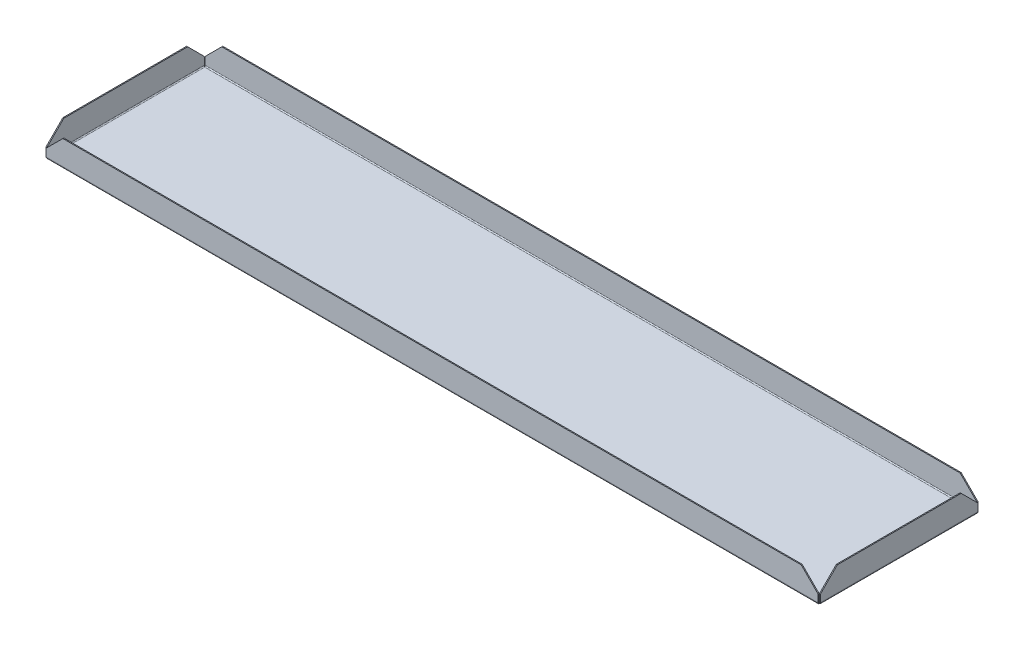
ISO-10303-21;
HEADER;
FILE_DESCRIPTION(('STEP AP214'),'2;1');
FILE_NAME('part.step','',(''),(''),'','','');
FILE_SCHEMA(('AUTOMOTIVE_DESIGN { 1 0 10303 214 1 1 1 1 }'));
ENDSEC;
DATA;
#1=APPLICATION_CONTEXT('core data for automotive mechanical design processes');
#2=APPLICATION_PROTOCOL_DEFINITION('international standard','automotive_design',2000,#1);
#3=PRODUCT_CONTEXT('',#1,'mechanical');
#4=PRODUCT('Part','Part','',(#3));
#5=PRODUCT_RELATED_PRODUCT_CATEGORY('part','',(#4));
#6=PRODUCT_DEFINITION_FORMATION('','',#4);
#7=PRODUCT_DEFINITION_CONTEXT('part definition',#1,'design');
#8=PRODUCT_DEFINITION('design','',#6,#7);
#9=PRODUCT_DEFINITION_SHAPE('','',#8);
#10=(LENGTH_UNIT() NAMED_UNIT(*) SI_UNIT(.MILLI.,.METRE.));
#11=(NAMED_UNIT(*) PLANE_ANGLE_UNIT() SI_UNIT($,.RADIAN.));
#12=(NAMED_UNIT(*) SI_UNIT($,.STERADIAN.) SOLID_ANGLE_UNIT());
#13=UNCERTAINTY_MEASURE_WITH_UNIT(LENGTH_MEASURE(1.E-05),#10,'distance_accuracy_value','');
#14=(GEOMETRIC_REPRESENTATION_CONTEXT(3) GLOBAL_UNCERTAINTY_ASSIGNED_CONTEXT((#13)) GLOBAL_UNIT_ASSIGNED_CONTEXT((#10,
#11,#12)) REPRESENTATION_CONTEXT('',''));
#15=CARTESIAN_POINT('',(0.,0.,0.));
#16=DIRECTION('',(0.,0.,1.));
#17=DIRECTION('',(1.,0.,0.));
#18=AXIS2_PLACEMENT_3D('',#15,#16,#17);
#19=CARTESIAN_POINT('',(-292.1,0.,-60.325));
#20=DIRECTION('',(0.,1.,0.));
#21=DIRECTION('',(0.,0.,1.));
#22=AXIS2_PLACEMENT_3D('',#19,#20,#21);
#23=PLANE('',#22);
#24=DIRECTION('',(1.,0.,0.));
#25=VECTOR('',#24,1.);
#26=CARTESIAN_POINT('',(-3213.1,0.,58.8517999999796));
#27=LINE('',#26,#25);
#28=CARTESIAN_POINT('',(-290.626799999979,0.,58.8517999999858));
#29=VERTEX_POINT('',#28);
#30=CARTESIAN_POINT('',(290.626799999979,0.,58.8517999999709));
#31=VERTEX_POINT('',#30);
#32=EDGE_CURVE('E368',#29,#31,#27,.T.);
#33=ORIENTED_EDGE('',*,*,#32,.F.);
#34=DIRECTION('',(0.,0.,1.));
#35=VECTOR('',#34,1.);
#36=CARTESIAN_POINT('',(-290.626799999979,0.,-60.3250000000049));
#37=LINE('',#36,#35);
#38=CARTESIAN_POINT('',(-290.626799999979,0.,-58.8517999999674));
#39=VERTEX_POINT('',#38);
#40=EDGE_CURVE('E263',#39,#29,#37,.T.);
#41=ORIENTED_EDGE('',*,*,#40,.F.);
#42=DIRECTION('',(-1.,0.,0.));
#43=VECTOR('',#42,1.);
#44=CARTESIAN_POINT('',(292.100000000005,0.,-58.8517999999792));
#45=LINE('',#44,#43);
#46=CARTESIAN_POINT('',(290.626799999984,0.,-58.8517999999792));
#47=VERTEX_POINT('',#46);
#48=EDGE_CURVE('E313',#47,#39,#45,.T.);
#49=ORIENTED_EDGE('',*,*,#48,.F.);
#50=DIRECTION('',(0.,0.,-1.));
#51=VECTOR('',#50,1.);
#52=CARTESIAN_POINT('',(290.626799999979,0.,60.3250000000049));
#53=LINE('',#52,#51);
#54=EDGE_CURVE('E357',#31,#47,#53,.T.);
#55=ORIENTED_EDGE('',*,*,#54,.F.);
#56=EDGE_LOOP('',(#33,#41,#49,#55));
#57=FACE_BOUND('',#56,.T.);
#58=ADVANCED_FACE('F40',(#57),#23,.F.);
#59=CARTESIAN_POINT('',(-292.1,0.7366,-60.325));
#60=DIRECTION('',(0.,1.,0.));
#61=DIRECTION('',(0.,0.,1.));
#62=AXIS2_PLACEMENT_3D('',#59,#60,#61);
#63=PLANE('',#62);
#64=DIRECTION('',(0.,0.,1.));
#65=VECTOR('',#64,1.);
#66=CARTESIAN_POINT('',(-290.626799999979,0.7366,-60.3250000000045));
#67=LINE('',#66,#65);
#68=CARTESIAN_POINT('',(-290.626799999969,0.7366,-58.8517999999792));
#69=VERTEX_POINT('',#68);
#70=CARTESIAN_POINT('',(-290.626799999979,0.7366,58.8517999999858));
#71=VERTEX_POINT('',#70);
#72=EDGE_CURVE('E247',#69,#71,#67,.T.);
#73=ORIENTED_EDGE('',*,*,#72,.T.);
#74=DIRECTION('',(1.,0.,0.));
#75=VECTOR('',#74,1.);
#76=CARTESIAN_POINT('',(-3213.1,0.7366,58.8517999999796));
#77=LINE('',#76,#75);
#78=CARTESIAN_POINT('',(290.626799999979,0.7366,58.8517999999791));
#79=VERTEX_POINT('',#78);
#80=EDGE_CURVE('E375',#71,#79,#77,.T.);
#81=ORIENTED_EDGE('',*,*,#80,.T.);
#82=DIRECTION('',(0.,0.,-1.));
#83=VECTOR('',#82,1.);
#84=CARTESIAN_POINT('',(290.626799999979,0.7366,60.3250000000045));
#85=LINE('',#84,#83);
#86=CARTESIAN_POINT('',(290.626799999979,0.7366,-58.8518000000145));
#87=VERTEX_POINT('',#86);
#88=EDGE_CURVE('E362',#79,#87,#85,.T.);
#89=ORIENTED_EDGE('',*,*,#88,.T.);
#90=DIRECTION('',(-1.,0.,0.));
#91=VECTOR('',#90,1.);
#92=CARTESIAN_POINT('',(292.100000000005,0.7366,-58.8517999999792));
#93=LINE('',#92,#91);
#94=EDGE_CURVE('E318',#87,#69,#93,.T.);
#95=ORIENTED_EDGE('',*,*,#94,.T.);
#96=EDGE_LOOP('',(#73,#81,#89,#95));
#97=FACE_BOUND('',#96,.T.);
#98=ADVANCED_FACE('F530',(#97),#63,.T.);
#99=CARTESIAN_POINT('',(-3213.1,19.7866,60.3250000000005));
#100=DIRECTION('',(0.,-1.,-1.1372763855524E-12));
#101=DIRECTION('',(1.,0.,0.));
#102=AXIS2_PLACEMENT_3D('',#99,#100,#101);
#103=PLANE('',#102);
#104=DIRECTION('',(1.,0.,0.));
#105=VECTOR('',#104,1.);
#106=CARTESIAN_POINT('',(-3213.1,19.7866,60.3250000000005));
#107=LINE('',#106,#105);
#108=CARTESIAN_POINT('',(-278.48379487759,19.7866,60.325));
#109=VERTEX_POINT('',#108);
#110=CARTESIAN_POINT('',(278.483794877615,19.7866,60.325));
#111=VERTEX_POINT('',#110);
#112=EDGE_CURVE('E395',#109,#111,#107,.T.);
#113=ORIENTED_EDGE('',*,*,#112,.T.);
#114=DIRECTION('',(0.,1.1372763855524E-12,-1.));
#115=VECTOR('',#114,1.);
#116=CARTESIAN_POINT('',(278.483794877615,19.7866,60.325));
#117=LINE('',#116,#115);
#118=CARTESIAN_POINT('',(278.483794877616,19.7866000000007,59.5884));
#119=VERTEX_POINT('',#118);
#120=EDGE_CURVE('E485',#111,#119,#117,.T.);
#121=ORIENTED_EDGE('',*,*,#120,.T.);
#122=DIRECTION('',(1.,0.,0.));
#123=VECTOR('',#122,1.);
#124=CARTESIAN_POINT('',(-3213.1,19.7866000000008,59.5884000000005));
#125=LINE('',#124,#123);
#126=CARTESIAN_POINT('',(-278.48379487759,19.7866000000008,59.5884));
#127=VERTEX_POINT('',#126);
#128=EDGE_CURVE('E402',#127,#119,#125,.T.);
#129=ORIENTED_EDGE('',*,*,#128,.F.);
#130=DIRECTION('',(0.,-1.1372763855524E-12,1.));
#131=VECTOR('',#130,1.);
#132=CARTESIAN_POINT('',(-278.48379487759,19.7866,60.325));
#133=LINE('',#132,#131);
#134=EDGE_CURVE('E453',#127,#109,#133,.T.);
#135=ORIENTED_EDGE('',*,*,#134,.T.);
#136=EDGE_LOOP('',(#113,#121,#129,#135));
#137=FACE_BOUND('',#136,.T.);
#138=ADVANCED_FACE('F491',(#137),#103,.F.);
#139=CARTESIAN_POINT('',(-291.18379487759,19.7866,60.325));
#140=DIRECTION('',(-1.,0.,0.));
#141=DIRECTION('',(0.,-1.,-1.1372763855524E-12));
#142=AXIS2_PLACEMENT_3D('',#139,#140,#141);
#143=PLANE('',#142);
#144=DIRECTION('',(0.,-1.,-1.1372763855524E-12));
#145=VECTOR('',#144,1.);
#146=CARTESIAN_POINT('',(-291.18379487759,19.7866,60.325));
#147=LINE('',#146,#145);
#148=CARTESIAN_POINT('',(-291.18379487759,7.08660000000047,60.3249999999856));
#149=VERTEX_POINT('',#148);
#150=CARTESIAN_POINT('',(-291.183794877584,1.47319999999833,60.3249999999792));
#151=VERTEX_POINT('',#150);
#152=EDGE_CURVE('E412',#149,#151,#147,.T.);
#153=ORIENTED_EDGE('',*,*,#152,.F.);
#154=DIRECTION('',(0.,-1.1372763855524E-12,1.));
#155=VECTOR('',#154,1.);
#156=CARTESIAN_POINT('',(-291.18379487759,7.0866,60.3249999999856));
#157=LINE('',#156,#155);
#158=CARTESIAN_POINT('',(-291.18379487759,7.08660000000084,59.5883999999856));
#159=VERTEX_POINT('',#158);
#160=EDGE_CURVE('E448',#149,#159,#157,.F.);
#161=ORIENTED_EDGE('',*,*,#160,.T.);
#162=DIRECTION('',(0.,-1.,-1.1372763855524E-12));
#163=VECTOR('',#162,1.);
#164=CARTESIAN_POINT('',(-291.18379487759,19.7866000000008,59.5884));
#165=LINE('',#164,#163);
#166=CARTESIAN_POINT('',(-291.183794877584,1.47319999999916,59.5883999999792));
#167=VERTEX_POINT('',#166);
#168=EDGE_CURVE('E401',#159,#167,#165,.T.);
#169=ORIENTED_EDGE('',*,*,#168,.T.);
#170=DIRECTION('',(0.,-1.1372763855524E-12,1.));
#171=VECTOR('',#170,1.);
#172=CARTESIAN_POINT('',(-291.18379487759,1.47319999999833,60.3249999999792));
#173=LINE('',#172,#171);
#174=EDGE_CURVE('E417',#151,#167,#173,.F.);
#175=ORIENTED_EDGE('',*,*,#174,.F.);
#176=EDGE_LOOP('',(#153,#161,#169,#175));
#177=FACE_BOUND('',#176,.T.);
#178=ADVANCED_FACE('F505',(#177),#143,.T.);
#179=CARTESIAN_POINT('',(291.183794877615,19.7866,60.325));
#180=DIRECTION('',(-1.,0.,0.));
#181=DIRECTION('',(0.,-1.,-1.1372763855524E-12));
#182=AXIS2_PLACEMENT_3D('',#179,#180,#181);
#183=PLANE('',#182);
#184=DIRECTION('',(0.,-1.,-1.1372763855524E-12));
#185=VECTOR('',#184,1.);
#186=CARTESIAN_POINT('',(291.183794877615,19.7866000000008,59.5884));
#187=LINE('',#186,#185);
#188=CARTESIAN_POINT('',(291.183794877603,1.47319999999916,59.5883999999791));
#189=VERTEX_POINT('',#188);
#190=CARTESIAN_POINT('',(291.183794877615,7.08660000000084,59.5883999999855));
#191=VERTEX_POINT('',#190);
#192=EDGE_CURVE('E404',#189,#191,#187,.F.);
#193=ORIENTED_EDGE('',*,*,#192,.T.);
#194=DIRECTION('',(0.,-1.1372763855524E-12,1.));
#195=VECTOR('',#194,1.);
#196=CARTESIAN_POINT('',(291.183794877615,7.0866,60.3249999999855));
#197=LINE('',#196,#195);
#198=CARTESIAN_POINT('',(291.183794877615,7.08660000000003,60.3249999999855));
#199=VERTEX_POINT('',#198);
#200=EDGE_CURVE('E48',#191,#199,#197,.T.);
#201=ORIENTED_EDGE('',*,*,#200,.T.);
#202=DIRECTION('',(0.,-1.,-1.1372763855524E-12));
#203=VECTOR('',#202,1.);
#204=CARTESIAN_POINT('',(291.183794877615,19.7866,60.325));
#205=LINE('',#204,#203);
#206=CARTESIAN_POINT('',(291.183794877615,1.47319999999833,60.3249999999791));
#207=VERTEX_POINT('',#206);
#208=EDGE_CURVE('E406',#207,#199,#205,.F.);
#209=ORIENTED_EDGE('',*,*,#208,.F.);
#210=DIRECTION('',(0.,-1.1372763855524E-12,1.));
#211=VECTOR('',#210,1.);
#212=CARTESIAN_POINT('',(291.183794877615,1.47319999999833,60.3249999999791));
#213=LINE('',#212,#211);
#214=EDGE_CURVE('E408',#207,#189,#213,.F.);
#215=ORIENTED_EDGE('',*,*,#214,.T.);
#216=EDGE_LOOP('',(#193,#201,#209,#215));
#217=FACE_BOUND('',#216,.T.);
#218=ADVANCED_FACE('F521',(#217),#183,.F.);
#219=CARTESIAN_POINT('',(-3213.1,19.7866000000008,59.5884000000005));
#220=DIRECTION('',(0.,-1.1372763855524E-12,1.));
#221=DIRECTION('',(0.,-1.,-1.1372763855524E-12));
#222=AXIS2_PLACEMENT_3D('',#219,#220,#221);
#223=PLANE('',#222);
#224=ORIENTED_EDGE('',*,*,#128,.T.);
#225=DIRECTION('',(-0.707106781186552,0.707106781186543,8.04276629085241E-13));
#226=VECTOR('',#225,1.);
#227=CARTESIAN_POINT('',(278.483794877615,19.7866000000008,59.5884));
#228=LINE('',#227,#226);
#229=EDGE_CURVE('E62',#119,#191,#228,.F.);
#230=ORIENTED_EDGE('',*,*,#229,.T.);
#231=ORIENTED_EDGE('',*,*,#192,.F.);
#232=DIRECTION('',(1.,0.,0.));
#233=VECTOR('',#232,1.);
#234=CARTESIAN_POINT('',(-3213.1,1.47319999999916,59.5883999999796));
#235=LINE('',#234,#233);
#236=EDGE_CURVE('E398',#167,#189,#235,.T.);
#237=ORIENTED_EDGE('',*,*,#236,.F.);
#238=ORIENTED_EDGE('',*,*,#168,.F.);
#239=DIRECTION('',(0.707106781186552,0.707106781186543,8.04075059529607E-13));
#240=VECTOR('',#239,1.);
#241=CARTESIAN_POINT('',(-291.18379487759,7.08660000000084,59.5883999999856));
#242=LINE('',#241,#240);
#243=EDGE_CURVE('E451',#159,#127,#242,.T.);
#244=ORIENTED_EDGE('',*,*,#243,.T.);
#245=EDGE_LOOP('',(#224,#230,#231,#237,#238,#244));
#246=FACE_BOUND('',#245,.T.);
#247=ADVANCED_FACE('F496',(#246),#223,.F.);
#248=CARTESIAN_POINT('',(-3213.1,19.7866,60.3250000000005));
#249=DIRECTION('',(0.,-1.1372763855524E-12,1.));
#250=DIRECTION('',(0.,-1.,-1.1372763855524E-12));
#251=AXIS2_PLACEMENT_3D('',#248,#249,#250);
#252=PLANE('',#251);
#253=ORIENTED_EDGE('',*,*,#208,.T.);
#254=DIRECTION('',(0.707106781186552,-0.707106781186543,-8.04276629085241E-13));
#255=VECTOR('',#254,1.);
#256=CARTESIAN_POINT('',(-1467.30810256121,1765.57849743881,60.3250000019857));
#257=LINE('',#256,#255);
#258=EDGE_CURVE('E11',#199,#111,#257,.F.);
#259=ORIENTED_EDGE('',*,*,#258,.T.);
#260=ORIENTED_EDGE('',*,*,#112,.F.);
#261=DIRECTION('',(-0.707106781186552,-0.707106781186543,-8.04075059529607E-13));
#262=VECTOR('',#261,1.);
#263=CARTESIAN_POINT('',(-1745.79189743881,-1447.5215025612,60.3249999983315));
#264=LINE('',#263,#262);
#265=EDGE_CURVE('E455',#109,#149,#264,.T.);
#266=ORIENTED_EDGE('',*,*,#265,.T.);
#267=ORIENTED_EDGE('',*,*,#152,.T.);
#268=DIRECTION('',(1.,0.,0.));
#269=VECTOR('',#268,1.);
#270=CARTESIAN_POINT('',(-3213.1,1.47319999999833,60.3249999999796));
#271=LINE('',#270,#269);
#272=EDGE_CURVE('E409',#151,#207,#271,.T.);
#273=ORIENTED_EDGE('',*,*,#272,.T.);
#274=EDGE_LOOP('',(#253,#259,#260,#266,#267,#273));
#275=FACE_BOUND('',#274,.T.);
#276=ADVANCED_FACE('F510',(#275),#252,.T.);
#277=CARTESIAN_POINT('',(-290.069805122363,1.4732,57.3785999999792));
#278=CARTESIAN_POINT('',(-290.069805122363,1.4732,57.6241333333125));
#279=CARTESIAN_POINT('',(-290.069805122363,1.4732,57.8696666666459));
#280=CARTESIAN_POINT('',(-290.069805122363,1.4732,58.1151999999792));
#281=CARTESIAN_POINT('',(-290.069805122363,4.4196,57.3785999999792));
#282=CARTESIAN_POINT('',(-290.069805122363,3.92853333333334,57.6241333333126));
#283=CARTESIAN_POINT('',(-290.069805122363,3.43746666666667,57.8696666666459));
#284=CARTESIAN_POINT('',(-290.069805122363,2.9464,58.1151999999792));
#285=CARTESIAN_POINT('',(-291.183794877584,4.4196,60.3249999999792));
#286=CARTESIAN_POINT('',(-291.183794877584,3.92853333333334,60.0794666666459));
#287=CARTESIAN_POINT('',(-291.183794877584,3.43746666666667,59.8339333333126));
#288=CARTESIAN_POINT('',(-291.183794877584,2.9464,59.5883999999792));
#289=CARTESIAN_POINT('',(-291.183794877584,1.4732,60.3249999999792));
#290=CARTESIAN_POINT('',(-291.183794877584,1.4732,60.0794666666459));
#291=CARTESIAN_POINT('',(-291.183794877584,1.4732,59.8339333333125));
#292=CARTESIAN_POINT('',(-291.183794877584,1.4732,59.5883999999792));
#293=CARTESIAN_POINT('',(-291.183794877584,-1.4732,60.3249999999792));
#294=CARTESIAN_POINT('',(-291.183794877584,-0.982133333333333,60.0794666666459));
#295=CARTESIAN_POINT('',(-291.183794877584,-0.491066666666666,59.8339333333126));
#296=CARTESIAN_POINT('',(-291.183794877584,0.,59.5883999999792));
#297=CARTESIAN_POINT('',(-290.069805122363,-1.4732,57.3785999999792));
#298=CARTESIAN_POINT('',(-290.069805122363,-0.982133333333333,57.6241333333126));
#299=CARTESIAN_POINT('',(-290.069805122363,-0.491066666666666,57.8696666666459));
#300=CARTESIAN_POINT('',(-290.069805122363,0.,58.1151999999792));
#301=CARTESIAN_POINT('',(-290.069805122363,1.4732,57.3785999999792));
#302=CARTESIAN_POINT('',(-290.069805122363,1.4732,57.6241333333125));
#303=CARTESIAN_POINT('',(-290.069805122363,1.4732,57.8696666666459));
#304=CARTESIAN_POINT('',(-290.069805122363,1.4732,58.1151999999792));
#305=(BOUNDED_SURFACE() B_SPLINE_SURFACE(3,3,((#277,#278,#279,#280),(#281,#282,#283,#284),(#285,
#286,#287,#288),(#289,#290,#291,#292),(#293,#294,#295,#296),(#297,#298,#299,#300),(#301,#302,
#303,#304)),.UNSPECIFIED.,.T.,.F.,.F.) B_SPLINE_SURFACE_WITH_KNOTS((4,3,4),(4,4),(0.,0.5,1.),
(0.,1.),.UNSPECIFIED.) GEOMETRIC_REPRESENTATION_ITEM() RATIONAL_B_SPLINE_SURFACE(((1.,1.,1.,1.),
(0.333333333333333,0.333333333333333,0.333333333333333,0.333333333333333),(0.333333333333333,
0.333333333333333,0.333333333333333,0.333333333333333),(1.,1.,1.,1.),(0.333333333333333,
0.333333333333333,0.333333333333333,0.333333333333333),(0.333333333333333,0.333333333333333,
0.333333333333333,0.333333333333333),(1.,1.,1.,1.))) REPRESENTATION_ITEM('') SURFACE());
#306=CARTESIAN_POINT('',(-290.626799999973,1.4732,58.8517999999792));
#307=DIRECTION('',(-0.797631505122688,0.,-0.603145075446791));
#308=DIRECTION('',(0.603145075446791,0.,-0.797631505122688));
#309=AXIS2_PLACEMENT_3D('',#306,#307,#308);
#310=ELLIPSE('',#309,0.923484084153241,0.7366);
#311=EDGE_CURVE('E378',#167,#71,#310,.F.);
#312=DIRECTION('',(0.,-1.,0.));
#313=VECTOR('',#312,1.);
#314=CARTESIAN_POINT('',(-290.626799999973,0.,58.8517999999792));
#315=LINE('',#314,#313);
#316=EDGE_CURVE('E392',#29,#71,#315,.F.);
#317=CARTESIAN_POINT('',(-290.626799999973,1.4732,58.8517999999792));
#318=DIRECTION('',(-0.935377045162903,0.,-0.353652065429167));
#319=DIRECTION('',(0.353652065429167,0.,-0.935377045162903));
#320=AXIS2_PLACEMENT_3D('',#317,#318,#319);
#321=ELLIPSE('',#320,1.57497985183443,1.4732);
#322=EDGE_CURVE('E387',#151,#29,#321,.F.);
#323=ORIENTED_EDGE('',*,*,#174,.T.);
#324=ORIENTED_EDGE('',*,*,#311,.T.);
#325=ORIENTED_EDGE('',*,*,#316,.F.);
#326=ORIENTED_EDGE('',*,*,#322,.F.);
#327=EDGE_LOOP('',(#323,#324,#325,#326));
#328=FACE_BOUND('',#327,.T.);
#329=ADVANCED_FACE('F514',(#328),#305,.F.);
#330=CARTESIAN_POINT('',(291.183794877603,1.4732,60.3249999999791));
#331=CARTESIAN_POINT('',(291.183794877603,1.4732,60.0794666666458));
#332=CARTESIAN_POINT('',(291.183794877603,1.4732,59.8339333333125));
#333=CARTESIAN_POINT('',(291.183794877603,1.4732,59.5883999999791));
#334=CARTESIAN_POINT('',(291.183794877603,4.4196,60.3249999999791));
#335=CARTESIAN_POINT('',(291.183794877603,3.92853333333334,60.0794666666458));
#336=CARTESIAN_POINT('',(291.183794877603,3.43746666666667,59.8339333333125));
#337=CARTESIAN_POINT('',(291.183794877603,2.9464,59.5883999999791));
#338=CARTESIAN_POINT('',(290.06980512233,4.4196,57.3785999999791));
#339=CARTESIAN_POINT('',(290.069805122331,3.92853333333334,57.6241333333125));
#340=CARTESIAN_POINT('',(290.069805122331,3.43746666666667,57.8696666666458));
#341=CARTESIAN_POINT('',(290.06980512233,2.9464,58.1151999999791));
#342=CARTESIAN_POINT('',(290.06980512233,1.4732,57.3785999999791));
#343=CARTESIAN_POINT('',(290.06980512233,1.4732,57.6241333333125));
#344=CARTESIAN_POINT('',(290.06980512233,1.4732,57.8696666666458));
#345=CARTESIAN_POINT('',(290.06980512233,1.4732,58.1151999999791));
#346=CARTESIAN_POINT('',(290.06980512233,-1.4732,57.3785999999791));
#347=CARTESIAN_POINT('',(290.069805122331,-0.982133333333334,57.6241333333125));
#348=CARTESIAN_POINT('',(290.069805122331,-0.491066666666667,57.8696666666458));
#349=CARTESIAN_POINT('',(290.06980512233,0.,58.1151999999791));
#350=CARTESIAN_POINT('',(291.183794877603,-1.4732,60.3249999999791));
#351=CARTESIAN_POINT('',(291.183794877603,-0.982133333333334,60.0794666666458));
#352=CARTESIAN_POINT('',(291.183794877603,-0.491066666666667,59.8339333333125));
#353=CARTESIAN_POINT('',(291.183794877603,0.,59.5883999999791));
#354=CARTESIAN_POINT('',(291.183794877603,1.4732,60.3249999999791));
#355=CARTESIAN_POINT('',(291.183794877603,1.4732,60.0794666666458));
#356=CARTESIAN_POINT('',(291.183794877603,1.4732,59.8339333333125));
#357=CARTESIAN_POINT('',(291.183794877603,1.4732,59.5883999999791));
#358=(BOUNDED_SURFACE() B_SPLINE_SURFACE(3,3,((#330,#331,#332,#333),(#334,#335,#336,#337),(#338,
#339,#340,#341),(#342,#343,#344,#345),(#346,#347,#348,#349),(#350,#351,#352,#353),(#354,#355,
#356,#357)),.UNSPECIFIED.,.T.,.F.,.F.) B_SPLINE_SURFACE_WITH_KNOTS((4,3,4),(4,4),(0.,0.5,1.),
(0.,1.),.UNSPECIFIED.) GEOMETRIC_REPRESENTATION_ITEM() RATIONAL_B_SPLINE_SURFACE(((1.,1.,1.,1.),
(0.333333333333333,0.333333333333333,0.333333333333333,0.333333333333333),(0.333333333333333,
0.333333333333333,0.333333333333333,0.333333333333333),(1.,1.,1.,1.),(0.333333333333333,
0.333333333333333,0.333333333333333,0.333333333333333),(0.333333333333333,0.333333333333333,
0.333333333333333,0.333333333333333),(1.,1.,1.,1.))) REPRESENTATION_ITEM('') SURFACE());
#359=CARTESIAN_POINT('',(290.626799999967,1.4732,58.8517999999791));
#360=DIRECTION('',(0.935377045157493,0.,-0.353652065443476));
#361=DIRECTION('',(0.353652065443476,0.,0.935377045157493));
#362=AXIS2_PLACEMENT_3D('',#359,#360,#361);
#363=ELLIPSE('',#362,1.57497985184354,1.4732);
#364=EDGE_CURVE('E379',#31,#207,#363,.F.);
#365=DIRECTION('',(0.,-1.,0.));
#366=VECTOR('',#365,1.);
#367=CARTESIAN_POINT('',(290.626799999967,0.,58.8517999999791));
#368=LINE('',#367,#366);
#369=EDGE_CURVE('E384',#31,#79,#368,.F.);
#370=CARTESIAN_POINT('',(290.626799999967,1.4732,58.8517999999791));
#371=DIRECTION('',(0.79763150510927,0.,-0.603145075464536));
#372=DIRECTION('',(0.603145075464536,0.,0.79763150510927));
#373=AXIS2_PLACEMENT_3D('',#370,#371,#372);
#374=ELLIPSE('',#373,0.923484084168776,0.7366);
#375=EDGE_CURVE('E382',#79,#189,#374,.F.);
#376=ORIENTED_EDGE('',*,*,#364,.F.);
#377=ORIENTED_EDGE('',*,*,#369,.T.);
#378=ORIENTED_EDGE('',*,*,#375,.T.);
#379=ORIENTED_EDGE('',*,*,#214,.F.);
#380=EDGE_LOOP('',(#376,#377,#378,#379));
#381=FACE_BOUND('',#380,.T.);
#382=ADVANCED_FACE('F601',(#381),#358,.F.);
#383=CARTESIAN_POINT('',(-3213.1,1.4732,58.8517999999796));
#384=DIRECTION('',(1.,0.,0.));
#385=DIRECTION('',(0.,0.,-1.));
#386=AXIS2_PLACEMENT_3D('',#383,#384,#385);
#387=CYLINDRICAL_SURFACE('',#386,0.7366);
#388=ORIENTED_EDGE('',*,*,#80,.F.);
#389=ORIENTED_EDGE('',*,*,#311,.F.);
#390=ORIENTED_EDGE('',*,*,#236,.T.);
#391=ORIENTED_EDGE('',*,*,#375,.F.);
#392=EDGE_LOOP('',(#388,#389,#390,#391));
#393=FACE_BOUND('',#392,.T.);
#394=ADVANCED_FACE('F600',(#393),#387,.F.);
#395=CARTESIAN_POINT('',(-3213.1,1.4732,58.8517999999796));
#396=DIRECTION('',(1.,0.,0.));
#397=DIRECTION('',(0.,0.,-1.));
#398=AXIS2_PLACEMENT_3D('',#395,#396,#397);
#399=CYLINDRICAL_SURFACE('',#398,1.4732);
#400=ORIENTED_EDGE('',*,*,#32,.T.);
#401=ORIENTED_EDGE('',*,*,#364,.T.);
#402=ORIENTED_EDGE('',*,*,#272,.F.);
#403=ORIENTED_EDGE('',*,*,#322,.T.);
#404=EDGE_LOOP('',(#400,#401,#402,#403));
#405=FACE_BOUND('',#404,.T.);
#406=ADVANCED_FACE('F517',(#405),#399,.T.);
#407=CARTESIAN_POINT('',(292.1,19.7866,2981.325));
#408=DIRECTION('',(-1.1372763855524E-12,-1.,0.));
#409=DIRECTION('',(0.,0.,-1.));
#410=AXIS2_PLACEMENT_3D('',#407,#408,#409);
#411=PLANE('',#410);
#412=DIRECTION('',(0.,0.,-1.));
#413=VECTOR('',#412,1.);
#414=CARTESIAN_POINT('',(291.3634,19.7866000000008,2981.325));
#415=LINE('',#414,#413);
#416=CARTESIAN_POINT('',(291.3634,19.7866000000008,46.7087948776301));
#417=VERTEX_POINT('',#416);
#418=CARTESIAN_POINT('',(291.3634,19.7866000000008,-46.7087948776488));
#419=VERTEX_POINT('',#418);
#420=EDGE_CURVE('E349',#417,#419,#415,.T.);
#421=ORIENTED_EDGE('',*,*,#420,.F.);
#422=DIRECTION('',(1.,-1.1372763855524E-12,0.));
#423=VECTOR('',#422,1.);
#424=CARTESIAN_POINT('',(292.1,19.7866,46.7087948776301));
#425=LINE('',#424,#423);
#426=CARTESIAN_POINT('',(292.1,19.7866,46.7087948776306));
#427=VERTEX_POINT('',#426);
#428=EDGE_CURVE('E481',#417,#427,#425,.T.);
#429=ORIENTED_EDGE('',*,*,#428,.T.);
#430=DIRECTION('',(0.,0.,-1.));
#431=VECTOR('',#430,1.);
#432=CARTESIAN_POINT('',(292.1,19.7866,2981.325));
#433=LINE('',#432,#431);
#434=CARTESIAN_POINT('',(292.1,19.7866,-46.7087948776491));
#435=VERTEX_POINT('',#434);
#436=EDGE_CURVE('E324',#427,#435,#433,.T.);
#437=ORIENTED_EDGE('',*,*,#436,.T.);
#438=DIRECTION('',(-1.,1.1372763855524E-12,0.));
#439=VECTOR('',#438,1.);
#440=CARTESIAN_POINT('',(292.1,19.7866,-46.7087948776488));
#441=LINE('',#440,#439);
#442=EDGE_CURVE('E457',#435,#419,#441,.T.);
#443=ORIENTED_EDGE('',*,*,#442,.T.);
#444=EDGE_LOOP('',(#421,#429,#437,#443));
#445=FACE_BOUND('',#444,.T.);
#446=ADVANCED_FACE('F668',(#445),#411,.F.);
#447=CARTESIAN_POINT('',(292.1,19.7866,59.4087948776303));
#448=DIRECTION('',(0.,0.,1.));
#449=DIRECTION('',(-1.1372763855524E-12,-1.,0.));
#450=AXIS2_PLACEMENT_3D('',#447,#448,#449);
#451=PLANE('',#450);
#452=DIRECTION('',(-1.1372763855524E-12,-1.,0.));
#453=VECTOR('',#452,1.);
#454=CARTESIAN_POINT('',(292.1,19.7866,59.4087948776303));
#455=LINE('',#454,#453);
#456=CARTESIAN_POINT('',(292.099999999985,7.08660000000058,59.4087948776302));
#457=VERTEX_POINT('',#456);
#458=CARTESIAN_POINT('',(292.099999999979,1.47319999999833,59.4087948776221));
#459=VERTEX_POINT('',#458);
#460=EDGE_CURVE('E340',#457,#459,#455,.T.);
#461=ORIENTED_EDGE('',*,*,#460,.F.);
#462=DIRECTION('',(1.,-1.1372763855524E-12,0.));
#463=VECTOR('',#462,1.);
#464=CARTESIAN_POINT('',(292.099999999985,7.0866,59.4087948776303));
#465=LINE('',#464,#463);
#466=CARTESIAN_POINT('',(291.363399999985,7.08660000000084,59.4087948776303));
#467=VERTEX_POINT('',#466);
#468=EDGE_CURVE('E476',#457,#467,#465,.F.);
#469=ORIENTED_EDGE('',*,*,#468,.T.);
#470=DIRECTION('',(-1.1372763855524E-12,-1.,0.));
#471=VECTOR('',#470,1.);
#472=CARTESIAN_POINT('',(291.3634,19.7866000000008,59.4087948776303));
#473=LINE('',#472,#471);
#474=CARTESIAN_POINT('',(291.363399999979,1.47319999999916,59.4087948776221));
#475=VERTEX_POINT('',#474);
#476=EDGE_CURVE('E335',#467,#475,#473,.T.);
#477=ORIENTED_EDGE('',*,*,#476,.T.);
#478=DIRECTION('',(1.,-1.1372763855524E-12,0.));
#479=VECTOR('',#478,1.);
#480=CARTESIAN_POINT('',(292.099999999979,1.47319999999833,59.4087948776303));
#481=LINE('',#480,#479);
#482=EDGE_CURVE('E336',#459,#475,#481,.F.);
#483=ORIENTED_EDGE('',*,*,#482,.F.);
#484=EDGE_LOOP('',(#461,#469,#477,#483));
#485=FACE_BOUND('',#484,.T.);
#486=ADVANCED_FACE('F667',(#485),#451,.T.);
#487=CARTESIAN_POINT('',(292.1,19.7866,-59.4087948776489));
#488=DIRECTION('',(0.,0.,1.));
#489=DIRECTION('',(-1.1372763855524E-12,-1.,0.));
#490=AXIS2_PLACEMENT_3D('',#487,#488,#489);
#491=PLANE('',#490);
#492=DIRECTION('',(-1.1372763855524E-12,-1.,0.));
#493=VECTOR('',#492,1.);
#494=CARTESIAN_POINT('',(291.3634,19.7866000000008,-59.4087948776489));
#495=LINE('',#494,#493);
#496=CARTESIAN_POINT('',(291.363399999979,1.47319999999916,-59.4087948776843));
#497=VERTEX_POINT('',#496);
#498=CARTESIAN_POINT('',(291.363399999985,7.08660000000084,-59.4087948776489));
#499=VERTEX_POINT('',#498);
#500=EDGE_CURVE('E334',#497,#499,#495,.F.);
#501=ORIENTED_EDGE('',*,*,#500,.T.);
#502=DIRECTION('',(1.,-1.1372763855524E-12,0.));
#503=VECTOR('',#502,1.);
#504=CARTESIAN_POINT('',(292.099999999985,7.0866,-59.4087948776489));
#505=LINE('',#504,#503);
#506=CARTESIAN_POINT('',(292.099999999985,7.08660000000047,-59.4087948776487));
#507=VERTEX_POINT('',#506);
#508=EDGE_CURVE('E462',#499,#507,#505,.T.);
#509=ORIENTED_EDGE('',*,*,#508,.T.);
#510=DIRECTION('',(-1.1372763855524E-12,-1.,0.));
#511=VECTOR('',#510,1.);
#512=CARTESIAN_POINT('',(292.1,19.7866,-59.4087948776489));
#513=LINE('',#512,#511);
#514=CARTESIAN_POINT('',(292.099999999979,1.47319999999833,-59.4087948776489));
#515=VERTEX_POINT('',#514);
#516=EDGE_CURVE('E341',#515,#507,#513,.F.);
#517=ORIENTED_EDGE('',*,*,#516,.F.);
#518=DIRECTION('',(1.,-1.1372763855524E-12,0.));
#519=VECTOR('',#518,1.);
#520=CARTESIAN_POINT('',(292.099999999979,1.47319999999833,-59.4087948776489));
#521=LINE('',#520,#519);
#522=EDGE_CURVE('E331',#515,#497,#521,.F.);
#523=ORIENTED_EDGE('',*,*,#522,.T.);
#524=EDGE_LOOP('',(#501,#509,#517,#523));
#525=FACE_BOUND('',#524,.T.);
#526=ADVANCED_FACE('F617',(#525),#491,.F.);
#527=CARTESIAN_POINT('',(291.3634,19.7866000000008,2981.325));
#528=DIRECTION('',(1.,-1.1372763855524E-12,0.));
#529=DIRECTION('',(-1.1372763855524E-12,-1.,0.));
#530=AXIS2_PLACEMENT_3D('',#527,#528,#529);
#531=PLANE('',#530);
#532=ORIENTED_EDGE('',*,*,#476,.F.);
#533=DIRECTION('',(8.04118357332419E-13,0.707106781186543,-0.707106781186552));
#534=VECTOR('',#533,1.);
#535=CARTESIAN_POINT('',(291.363399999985,7.08660000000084,59.4087948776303));
#536=LINE('',#535,#534);
#537=EDGE_CURVE('E479',#467,#417,#536,.T.);
#538=ORIENTED_EDGE('',*,*,#537,.T.);
#539=ORIENTED_EDGE('',*,*,#420,.T.);
#540=DIRECTION('',(8.04233331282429E-13,0.707106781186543,0.707106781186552));
#541=VECTOR('',#540,1.);
#542=CARTESIAN_POINT('',(291.3634,19.7866000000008,-46.7087948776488));
#543=LINE('',#542,#541);
#544=EDGE_CURVE('E460',#419,#499,#543,.F.);
#545=ORIENTED_EDGE('',*,*,#544,.T.);
#546=ORIENTED_EDGE('',*,*,#500,.F.);
#547=DIRECTION('',(0.,0.,-1.));
#548=VECTOR('',#547,1.);
#549=CARTESIAN_POINT('',(291.363399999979,1.47319999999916,2981.325));
#550=LINE('',#549,#548);
#551=EDGE_CURVE('E354',#475,#497,#550,.T.);
#552=ORIENTED_EDGE('',*,*,#551,.F.);
#553=EDGE_LOOP('',(#532,#538,#539,#545,#546,#552));
#554=FACE_BOUND('',#553,.T.);
#555=ADVANCED_FACE('F612',(#554),#531,.F.);
#556=CARTESIAN_POINT('',(292.1,19.7866,2981.325));
#557=DIRECTION('',(1.,-1.1372763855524E-12,0.));
#558=DIRECTION('',(-1.1372763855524E-12,-1.,0.));
#559=AXIS2_PLACEMENT_3D('',#556,#557,#558);
#560=PLANE('',#559);
#561=ORIENTED_EDGE('',*,*,#436,.F.);
#562=DIRECTION('',(-8.04118357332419E-13,-0.707106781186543,0.707106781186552));
#563=VECTOR('',#562,1.);
#564=CARTESIAN_POINT('',(292.099999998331,-1447.52150256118,1514.01689743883));
#565=LINE('',#564,#563);
#566=EDGE_CURVE('E483',#427,#457,#565,.T.);
#567=ORIENTED_EDGE('',*,*,#566,.T.);
#568=ORIENTED_EDGE('',*,*,#460,.T.);
#569=DIRECTION('',(0.,0.,-1.));
#570=VECTOR('',#569,1.);
#571=CARTESIAN_POINT('',(292.099999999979,1.47319999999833,2981.325));
#572=LINE('',#571,#570);
#573=EDGE_CURVE('E344',#459,#515,#572,.T.);
#574=ORIENTED_EDGE('',*,*,#573,.T.);
#575=ORIENTED_EDGE('',*,*,#516,.T.);
#576=DIRECTION('',(-8.04233331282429E-13,-0.707106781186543,-0.707106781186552));
#577=VECTOR('',#576,1.);
#578=CARTESIAN_POINT('',(292.100000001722,1533.80349743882,1467.30810256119));
#579=LINE('',#578,#577);
#580=EDGE_CURVE('E464',#507,#435,#579,.F.);
#581=ORIENTED_EDGE('',*,*,#580,.T.);
#582=EDGE_LOOP('',(#561,#567,#568,#574,#575,#581));
#583=FACE_BOUND('',#582,.T.);
#584=ADVANCED_FACE('F674',(#583),#560,.T.);
#585=CARTESIAN_POINT('',(289.153599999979,1.4732,58.2948051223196));
#586=CARTESIAN_POINT('',(289.399133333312,1.4732,58.2948051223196));
#587=CARTESIAN_POINT('',(289.644666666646,1.4732,58.2948051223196));
#588=CARTESIAN_POINT('',(289.890199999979,1.4732,58.2948051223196));
#589=CARTESIAN_POINT('',(289.153599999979,4.4196,58.2948051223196));
#590=CARTESIAN_POINT('',(289.399133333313,3.92853333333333,58.2948051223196));
#591=CARTESIAN_POINT('',(289.644666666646,3.43746666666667,58.2948051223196));
#592=CARTESIAN_POINT('',(289.890199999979,2.9464,58.2948051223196));
#593=CARTESIAN_POINT('',(292.099999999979,4.4196,59.4087948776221));
#594=CARTESIAN_POINT('',(291.854466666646,3.92853333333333,59.4087948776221));
#595=CARTESIAN_POINT('',(291.608933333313,3.43746666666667,59.4087948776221));
#596=CARTESIAN_POINT('',(291.363399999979,2.9464,59.4087948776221));
#597=CARTESIAN_POINT('',(292.099999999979,1.4732,59.4087948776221));
#598=CARTESIAN_POINT('',(291.854466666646,1.4732,59.4087948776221));
#599=CARTESIAN_POINT('',(291.608933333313,1.4732,59.4087948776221));
#600=CARTESIAN_POINT('',(291.363399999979,1.4732,59.4087948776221));
#601=CARTESIAN_POINT('',(292.099999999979,-1.4732,59.4087948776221));
#602=CARTESIAN_POINT('',(291.854466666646,-0.982133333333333,59.4087948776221));
#603=CARTESIAN_POINT('',(291.608933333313,-0.491066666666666,59.4087948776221));
#604=CARTESIAN_POINT('',(291.363399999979,0.,59.4087948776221));
#605=CARTESIAN_POINT('',(289.153599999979,-1.4732,58.2948051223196));
#606=CARTESIAN_POINT('',(289.399133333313,-0.982133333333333,58.2948051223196));
#607=CARTESIAN_POINT('',(289.644666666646,-0.491066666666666,58.2948051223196));
#608=CARTESIAN_POINT('',(289.890199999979,0.,58.2948051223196));
#609=CARTESIAN_POINT('',(289.153599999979,1.4732,58.2948051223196));
#610=CARTESIAN_POINT('',(289.399133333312,1.4732,58.2948051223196));
#611=CARTESIAN_POINT('',(289.644666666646,1.4732,58.2948051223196));
#612=CARTESIAN_POINT('',(289.890199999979,1.4732,58.2948051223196));
#613=(BOUNDED_SURFACE() B_SPLINE_SURFACE(3,3,((#585,#586,#587,#588),(#589,#590,#591,#592),(#593,
#594,#595,#596),(#597,#598,#599,#600),(#601,#602,#603,#604),(#605,#606,#607,#608),(#609,#610,
#611,#612)),.UNSPECIFIED.,.T.,.F.,.F.) B_SPLINE_SURFACE_WITH_KNOTS((4,3,4),(4,4),(0.,0.5,1.),
(0.,1.),.UNSPECIFIED.) GEOMETRIC_REPRESENTATION_ITEM() RATIONAL_B_SPLINE_SURFACE(((1.,1.,1.,1.),
(0.333333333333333,0.333333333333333,0.333333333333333,0.333333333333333),(0.333333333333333,
0.333333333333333,0.333333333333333,0.333333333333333),(1.,1.,1.,1.),(0.333333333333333,
0.333333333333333,0.333333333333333,0.333333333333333),(0.333333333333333,0.333333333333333,
0.333333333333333,0.333333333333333),(1.,1.,1.,1.))) REPRESENTATION_ITEM('') SURFACE());
#614=CARTESIAN_POINT('',(290.626799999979,1.4732,58.8517999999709));
#615=DIRECTION('',(-0.603145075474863,0.,0.797631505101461));
#616=DIRECTION('',(-0.797631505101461,0.,-0.603145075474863));
#617=AXIS2_PLACEMENT_3D('',#614,#615,#616);
#618=ELLIPSE('',#617,0.923484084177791,0.7366);
#619=EDGE_CURVE('E339',#475,#79,#618,.F.);
#620=CARTESIAN_POINT('',(290.626799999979,1.4732,58.8517999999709));
#621=DIRECTION('',(-0.353652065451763,0.,0.93537704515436));
#622=DIRECTION('',(-0.93537704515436,0.,-0.353652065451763));
#623=AXIS2_PLACEMENT_3D('',#620,#621,#622);
#624=ELLIPSE('',#623,1.57497985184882,1.4732);
#625=EDGE_CURVE('E366',#459,#31,#624,.F.);
#626=ORIENTED_EDGE('',*,*,#482,.T.);
#627=ORIENTED_EDGE('',*,*,#619,.T.);
#628=ORIENTED_EDGE('',*,*,#369,.F.);
#629=ORIENTED_EDGE('',*,*,#625,.F.);
#630=EDGE_LOOP('',(#626,#627,#628,#629));
#631=FACE_BOUND('',#630,.T.);
#632=ADVANCED_FACE('F605',(#631),#613,.F.);
#633=CARTESIAN_POINT('',(292.099999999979,1.4732,-59.4087948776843));
#634=CARTESIAN_POINT('',(291.854466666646,1.4732,-59.4087948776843));
#635=CARTESIAN_POINT('',(291.608933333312,1.4732,-59.4087948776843));
#636=CARTESIAN_POINT('',(291.363399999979,1.4732,-59.4087948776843));
#637=CARTESIAN_POINT('',(292.099999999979,4.4196,-59.4087948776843));
#638=CARTESIAN_POINT('',(291.854466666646,3.92853333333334,-59.4087948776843));
#639=CARTESIAN_POINT('',(291.608933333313,3.43746666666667,-59.4087948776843));
#640=CARTESIAN_POINT('',(291.363399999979,2.9464,-59.4087948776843));
#641=CARTESIAN_POINT('',(289.153599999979,4.4196,-58.2948051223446));
#642=CARTESIAN_POINT('',(289.399133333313,3.92853333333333,-58.2948051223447));
#643=CARTESIAN_POINT('',(289.644666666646,3.43746666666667,-58.2948051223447));
#644=CARTESIAN_POINT('',(289.890199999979,2.9464,-58.2948051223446));
#645=CARTESIAN_POINT('',(289.153599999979,1.4732,-58.2948051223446));
#646=CARTESIAN_POINT('',(289.399133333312,1.4732,-58.2948051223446));
#647=CARTESIAN_POINT('',(289.644666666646,1.4732,-58.2948051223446));
#648=CARTESIAN_POINT('',(289.890199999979,1.4732,-58.2948051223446));
#649=CARTESIAN_POINT('',(289.153599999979,-1.4732,-58.2948051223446));
#650=CARTESIAN_POINT('',(289.399133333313,-0.982133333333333,-58.2948051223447));
#651=CARTESIAN_POINT('',(289.644666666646,-0.491066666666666,-58.2948051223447));
#652=CARTESIAN_POINT('',(289.890199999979,0.,-58.2948051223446));
#653=CARTESIAN_POINT('',(292.099999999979,-1.4732,-59.4087948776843));
#654=CARTESIAN_POINT('',(291.854466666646,-0.982133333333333,-59.4087948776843));
#655=CARTESIAN_POINT('',(291.608933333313,-0.491066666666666,-59.4087948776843));
#656=CARTESIAN_POINT('',(291.363399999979,0.,-59.4087948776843));
#657=CARTESIAN_POINT('',(292.099999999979,1.4732,-59.4087948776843));
#658=CARTESIAN_POINT('',(291.854466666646,1.4732,-59.4087948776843));
#659=CARTESIAN_POINT('',(291.608933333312,1.4732,-59.4087948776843));
#660=CARTESIAN_POINT('',(291.363399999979,1.4732,-59.4087948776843));
#661=(BOUNDED_SURFACE() B_SPLINE_SURFACE(3,3,((#633,#634,#635,#636),(#637,#638,#639,#640),(#641,
#642,#643,#644),(#645,#646,#647,#648),(#649,#650,#651,#652),(#653,#654,#655,#656),(#657,#658,
#659,#660)),.UNSPECIFIED.,.T.,.F.,.F.) B_SPLINE_SURFACE_WITH_KNOTS((4,3,4),(4,4),(0.,0.5,1.),
(0.,1.),.UNSPECIFIED.) GEOMETRIC_REPRESENTATION_ITEM() RATIONAL_B_SPLINE_SURFACE(((1.,1.,1.,1.),
(0.333333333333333,0.333333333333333,0.333333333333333,0.333333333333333),(0.333333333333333,
0.333333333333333,0.333333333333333,0.333333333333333),(1.,1.,1.,1.),(0.333333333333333,
0.333333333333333,0.333333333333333,0.333333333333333),(0.333333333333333,0.333333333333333,
0.333333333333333,0.333333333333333),(1.,1.,1.,1.))) REPRESENTATION_ITEM('') SURFACE());
#662=CARTESIAN_POINT('',(290.626799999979,1.4732,-58.8518000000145));
#663=DIRECTION('',(-0.353652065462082,0.,-0.935377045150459));
#664=DIRECTION('',(0.935377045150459,0.,-0.353652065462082));
#665=AXIS2_PLACEMENT_3D('',#662,#663,#664);
#666=ELLIPSE('',#665,1.57497985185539,1.4732);
#667=EDGE_CURVE('E363',#47,#515,#666,.F.);
#668=DIRECTION('',(0.,-1.,0.));
#669=VECTOR('',#668,1.);
#670=CARTESIAN_POINT('',(290.626799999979,0.,-58.8518000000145));
#671=LINE('',#670,#669);
#672=EDGE_CURVE('E359',#47,#87,#671,.F.);
#673=CARTESIAN_POINT('',(290.626799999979,1.4732,-58.8518000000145));
#674=DIRECTION('',(-0.603145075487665,0.,-0.797631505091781));
#675=DIRECTION('',(0.797631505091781,0.,-0.603145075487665));
#676=AXIS2_PLACEMENT_3D('',#673,#674,#675);
#677=ELLIPSE('',#676,0.923484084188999,0.7366);
#678=EDGE_CURVE('E358',#87,#497,#677,.F.);
#679=ORIENTED_EDGE('',*,*,#667,.F.);
#680=ORIENTED_EDGE('',*,*,#672,.T.);
#681=ORIENTED_EDGE('',*,*,#678,.T.);
#682=ORIENTED_EDGE('',*,*,#522,.F.);
#683=EDGE_LOOP('',(#679,#680,#681,#682));
#684=FACE_BOUND('',#683,.T.);
#685=ADVANCED_FACE('F596',(#684),#661,.F.);
#686=CARTESIAN_POINT('',(290.626799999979,1.4732,60.3250000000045));
#687=DIRECTION('',(0.,0.,-1.));
#688=DIRECTION('',(-1.,0.,0.));
#689=AXIS2_PLACEMENT_3D('',#686,#687,#688);
#690=CYLINDRICAL_SURFACE('',#689,0.7366);
#691=ORIENTED_EDGE('',*,*,#88,.F.);
#692=ORIENTED_EDGE('',*,*,#619,.F.);
#693=ORIENTED_EDGE('',*,*,#551,.T.);
#694=ORIENTED_EDGE('',*,*,#678,.F.);
#695=EDGE_LOOP('',(#691,#692,#693,#694));
#696=FACE_BOUND('',#695,.T.);
#697=ADVANCED_FACE('F590',(#696),#690,.F.);
#698=CARTESIAN_POINT('',(290.626799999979,1.4732,60.3250000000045));
#699=DIRECTION('',(0.,0.,-1.));
#700=DIRECTION('',(-1.,0.,0.));
#701=AXIS2_PLACEMENT_3D('',#698,#699,#700);
#702=CYLINDRICAL_SURFACE('',#701,1.4732);
#703=ORIENTED_EDGE('',*,*,#54,.T.);
#704=ORIENTED_EDGE('',*,*,#667,.T.);
#705=ORIENTED_EDGE('',*,*,#573,.F.);
#706=ORIENTED_EDGE('',*,*,#625,.T.);
#707=EDGE_LOOP('',(#703,#704,#705,#706));
#708=FACE_BOUND('',#707,.T.);
#709=ADVANCED_FACE('F619',(#708),#702,.T.);
#710=CARTESIAN_POINT('',(3213.1,19.7866,-60.3250000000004));
#711=DIRECTION('',(0.,-1.,1.1372763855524E-12));
#712=DIRECTION('',(-1.,0.,0.));
#713=AXIS2_PLACEMENT_3D('',#710,#711,#712);
#714=PLANE('',#713);
#715=DIRECTION('',(-1.,0.,0.));
#716=VECTOR('',#715,1.);
#717=CARTESIAN_POINT('',(3213.1,19.7866000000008,-59.5884000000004));
#718=LINE('',#717,#716);
#719=CARTESIAN_POINT('',(278.48379487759,19.7866000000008,-59.5884000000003));
#720=VERTEX_POINT('',#719);
#721=CARTESIAN_POINT('',(-278.483794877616,19.7866000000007,-59.5884000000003));
#722=VERTEX_POINT('',#721);
#723=EDGE_CURVE('E305',#720,#722,#718,.T.);
#724=ORIENTED_EDGE('',*,*,#723,.F.);
#725=DIRECTION('',(0.,-1.1372763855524E-12,-1.));
#726=VECTOR('',#725,1.);
#727=CARTESIAN_POINT('',(278.48379487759,19.7866,-60.3250000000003));
#728=LINE('',#727,#726);
#729=CARTESIAN_POINT('',(278.48379487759,19.7866000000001,-60.3250000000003));
#730=VERTEX_POINT('',#729);
#731=EDGE_CURVE('E472',#720,#730,#728,.T.);
#732=ORIENTED_EDGE('',*,*,#731,.T.);
#733=DIRECTION('',(-1.,0.,0.));
#734=VECTOR('',#733,1.);
#735=CARTESIAN_POINT('',(3213.1,19.7866,-60.3250000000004));
#736=LINE('',#735,#734);
#737=CARTESIAN_POINT('',(-278.483794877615,19.7866,-60.3250000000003));
#738=VERTEX_POINT('',#737);
#739=EDGE_CURVE('E300',#730,#738,#736,.T.);
#740=ORIENTED_EDGE('',*,*,#739,.T.);
#741=DIRECTION('',(0.,1.1372763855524E-12,1.));
#742=VECTOR('',#741,1.);
#743=CARTESIAN_POINT('',(-278.483794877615,19.7866,-60.3250000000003));
#744=LINE('',#743,#742);
#745=EDGE_CURVE('E429',#738,#722,#744,.T.);
#746=ORIENTED_EDGE('',*,*,#745,.T.);
#747=EDGE_LOOP('',(#724,#732,#740,#746));
#748=FACE_BOUND('',#747,.T.);
#749=ADVANCED_FACE('F633',(#748),#714,.F.);
#750=CARTESIAN_POINT('',(291.183794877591,19.7866,-60.3250000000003));
#751=DIRECTION('',(1.,0.,0.));
#752=DIRECTION('',(0.,-1.,1.1372763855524E-12));
#753=AXIS2_PLACEMENT_3D('',#750,#751,#752);
#754=PLANE('',#753);
#755=DIRECTION('',(0.,-1.,1.1372763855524E-12));
#756=VECTOR('',#755,1.);
#757=CARTESIAN_POINT('',(291.183794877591,19.7866,-60.3250000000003));
#758=LINE('',#757,#756);
#759=CARTESIAN_POINT('',(291.183794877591,7.08660000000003,-60.3249999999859));
#760=VERTEX_POINT('',#759);
#761=CARTESIAN_POINT('',(291.183794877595,1.47319999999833,-60.3249999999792));
#762=VERTEX_POINT('',#761);
#763=EDGE_CURVE('E295',#760,#762,#758,.T.);
#764=ORIENTED_EDGE('',*,*,#763,.F.);
#765=DIRECTION('',(0.,-1.1372763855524E-12,-1.));
#766=VECTOR('',#765,1.);
#767=CARTESIAN_POINT('',(291.183794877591,7.0866,-60.3249999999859));
#768=LINE('',#767,#766);
#769=CARTESIAN_POINT('',(291.183794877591,7.08660000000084,-59.5883999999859));
#770=VERTEX_POINT('',#769);
#771=EDGE_CURVE('E467',#760,#770,#768,.F.);
#772=ORIENTED_EDGE('',*,*,#771,.T.);
#773=DIRECTION('',(0.,-1.,1.1372763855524E-12));
#774=VECTOR('',#773,1.);
#775=CARTESIAN_POINT('',(291.183794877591,19.7866000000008,-59.5884000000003));
#776=LINE('',#775,#774);
#777=CARTESIAN_POINT('',(291.183794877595,1.47319999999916,-59.5883999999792));
#778=VERTEX_POINT('',#777);
#779=EDGE_CURVE('E290',#770,#778,#776,.T.);
#780=ORIENTED_EDGE('',*,*,#779,.T.);
#781=DIRECTION('',(0.,-1.1372763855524E-12,-1.));
#782=VECTOR('',#781,1.);
#783=CARTESIAN_POINT('',(291.183794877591,1.47319999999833,-60.3249999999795));
#784=LINE('',#783,#782);
#785=EDGE_CURVE('E291',#762,#778,#784,.F.);
#786=ORIENTED_EDGE('',*,*,#785,.F.);
#787=EDGE_LOOP('',(#764,#772,#780,#786));
#788=FACE_BOUND('',#787,.T.);
#789=ADVANCED_FACE('F573',(#788),#754,.T.);
#790=CARTESIAN_POINT('',(-291.183794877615,19.7866,-60.3250000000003));
#791=DIRECTION('',(1.,0.,0.));
#792=DIRECTION('',(0.,-1.,1.1372763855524E-12));
#793=AXIS2_PLACEMENT_3D('',#790,#791,#792);
#794=PLANE('',#793);
#795=DIRECTION('',(0.,-1.,1.1372763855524E-12));
#796=VECTOR('',#795,1.);
#797=CARTESIAN_POINT('',(-291.183794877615,19.7866000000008,-59.5884000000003));
#798=LINE('',#797,#796);
#799=CARTESIAN_POINT('',(-291.183794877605,1.47319999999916,-59.5883999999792));
#800=VERTEX_POINT('',#799);
#801=CARTESIAN_POINT('',(-291.183794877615,7.08660000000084,-59.5883999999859));
#802=VERTEX_POINT('',#801);
#803=EDGE_CURVE('E289',#800,#802,#798,.F.);
#804=ORIENTED_EDGE('',*,*,#803,.T.);
#805=DIRECTION('',(0.,-1.1372763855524E-12,-1.));
#806=VECTOR('',#805,1.);
#807=CARTESIAN_POINT('',(-291.183794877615,7.0866,-60.3249999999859));
#808=LINE('',#807,#806);
#809=CARTESIAN_POINT('',(-291.183794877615,7.08660000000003,-60.3249999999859));
#810=VERTEX_POINT('',#809);
#811=EDGE_CURVE('E434',#802,#810,#808,.T.);
#812=ORIENTED_EDGE('',*,*,#811,.T.);
#813=DIRECTION('',(0.,-1.,1.1372763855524E-12));
#814=VECTOR('',#813,1.);
#815=CARTESIAN_POINT('',(-291.183794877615,19.7866,-60.3250000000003));
#816=LINE('',#815,#814);
#817=CARTESIAN_POINT('',(-291.183794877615,1.47319999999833,-60.3249999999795));
#818=VERTEX_POINT('',#817);
#819=EDGE_CURVE('E296',#818,#810,#816,.F.);
#820=ORIENTED_EDGE('',*,*,#819,.F.);
#821=DIRECTION('',(0.,-1.1372763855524E-12,-1.));
#822=VECTOR('',#821,1.);
#823=CARTESIAN_POINT('',(-291.183794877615,1.47319999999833,-60.3249999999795));
#824=LINE('',#823,#822);
#825=EDGE_CURVE('E286',#818,#800,#824,.F.);
#826=ORIENTED_EDGE('',*,*,#825,.T.);
#827=EDGE_LOOP('',(#804,#812,#820,#826));
#828=FACE_BOUND('',#827,.T.);
#829=ADVANCED_FACE('F634',(#828),#794,.F.);
#830=CARTESIAN_POINT('',(3213.1,19.7866000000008,-59.5884000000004));
#831=DIRECTION('',(0.,-1.1372763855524E-12,-1.));
#832=DIRECTION('',(0.,-1.,1.1372763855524E-12));
#833=AXIS2_PLACEMENT_3D('',#830,#831,#832);
#834=PLANE('',#833);
#835=ORIENTED_EDGE('',*,*,#779,.F.);
#836=DIRECTION('',(-0.707106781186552,0.707106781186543,-8.04161655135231E-13));
#837=VECTOR('',#836,1.);
#838=CARTESIAN_POINT('',(291.183794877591,7.08660000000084,-59.5883999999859));
#839=LINE('',#838,#837);
#840=EDGE_CURVE('E470',#770,#720,#839,.T.);
#841=ORIENTED_EDGE('',*,*,#840,.T.);
#842=ORIENTED_EDGE('',*,*,#723,.T.);
#843=DIRECTION('',(0.707106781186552,0.707106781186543,-8.04190033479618E-13));
#844=VECTOR('',#843,1.);
#845=CARTESIAN_POINT('',(-278.483794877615,19.7866000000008,-59.5884000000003));
#846=LINE('',#845,#844);
#847=EDGE_CURVE('E432',#722,#802,#846,.F.);
#848=ORIENTED_EDGE('',*,*,#847,.T.);
#849=ORIENTED_EDGE('',*,*,#803,.F.);
#850=DIRECTION('',(-1.,0.,0.));
#851=VECTOR('',#850,1.);
#852=CARTESIAN_POINT('',(3213.1,1.47319999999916,-59.5883999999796));
#853=LINE('',#852,#851);
#854=EDGE_CURVE('E310',#778,#800,#853,.T.);
#855=ORIENTED_EDGE('',*,*,#854,.F.);
#856=EDGE_LOOP('',(#835,#841,#842,#848,#849,#855));
#857=FACE_BOUND('',#856,.T.);
#858=ADVANCED_FACE('F584',(#857),#834,.F.);
#859=CARTESIAN_POINT('',(3213.1,19.7866,-60.3250000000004));
#860=DIRECTION('',(0.,-1.1372763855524E-12,-1.));
#861=DIRECTION('',(0.,-1.,1.1372763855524E-12));
#862=AXIS2_PLACEMENT_3D('',#859,#860,#861);
#863=PLANE('',#862);
#864=ORIENTED_EDGE('',*,*,#739,.F.);
#865=DIRECTION('',(0.707106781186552,-0.707106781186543,8.04161655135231E-13));
#866=VECTOR('',#865,1.);
#867=CARTESIAN_POINT('',(1745.79189743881,-1447.5215025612,-60.3249999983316));
#868=LINE('',#867,#866);
#869=EDGE_CURVE('E474',#730,#760,#868,.T.);
#870=ORIENTED_EDGE('',*,*,#869,.T.);
#871=ORIENTED_EDGE('',*,*,#763,.T.);
#872=DIRECTION('',(-1.,0.,0.));
#873=VECTOR('',#872,1.);
#874=CARTESIAN_POINT('',(3213.1,1.47319999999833,-60.3249999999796));
#875=LINE('',#874,#873);
#876=EDGE_CURVE('E299',#762,#818,#875,.T.);
#877=ORIENTED_EDGE('',*,*,#876,.T.);
#878=ORIENTED_EDGE('',*,*,#819,.T.);
#879=DIRECTION('',(-0.707106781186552,-0.707106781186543,8.04190033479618E-13));
#880=VECTOR('',#879,1.);
#881=CARTESIAN_POINT('',(1467.30810256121,1765.57849743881,-60.3250000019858));
#882=LINE('',#881,#880);
#883=EDGE_CURVE('E436',#810,#738,#882,.F.);
#884=ORIENTED_EDGE('',*,*,#883,.T.);
#885=EDGE_LOOP('',(#864,#870,#871,#877,#878,#884));
#886=FACE_BOUND('',#885,.T.);
#887=ADVANCED_FACE('F569',(#886),#863,.T.);
#888=CARTESIAN_POINT('',(290.069805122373,1.4732,-57.3785999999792));
#889=CARTESIAN_POINT('',(290.069805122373,1.4732,-57.6241333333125));
#890=CARTESIAN_POINT('',(290.069805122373,1.4732,-57.8696666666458));
#891=CARTESIAN_POINT('',(290.069805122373,1.4732,-58.1151999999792));
#892=CARTESIAN_POINT('',(290.069805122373,4.4196,-57.3785999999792));
#893=CARTESIAN_POINT('',(290.069805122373,3.92853333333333,-57.6241333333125));
#894=CARTESIAN_POINT('',(290.069805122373,3.43746666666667,-57.8696666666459));
#895=CARTESIAN_POINT('',(290.069805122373,2.9464,-58.1151999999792));
#896=CARTESIAN_POINT('',(291.183794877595,4.4196,-60.3249999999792));
#897=CARTESIAN_POINT('',(291.183794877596,3.92853333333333,-60.0794666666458));
#898=CARTESIAN_POINT('',(291.183794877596,3.43746666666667,-59.8339333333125));
#899=CARTESIAN_POINT('',(291.183794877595,2.9464,-59.5883999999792));
#900=CARTESIAN_POINT('',(291.183794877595,1.4732,-60.3249999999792));
#901=CARTESIAN_POINT('',(291.183794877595,1.4732,-60.0794666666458));
#902=CARTESIAN_POINT('',(291.183794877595,1.4732,-59.8339333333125));
#903=CARTESIAN_POINT('',(291.183794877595,1.4732,-59.5883999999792));
#904=CARTESIAN_POINT('',(291.183794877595,-1.4732,-60.3249999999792));
#905=CARTESIAN_POINT('',(291.183794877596,-0.982133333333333,-60.0794666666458));
#906=CARTESIAN_POINT('',(291.183794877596,-0.491066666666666,-59.8339333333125));
#907=CARTESIAN_POINT('',(291.183794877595,0.,-59.5883999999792));
#908=CARTESIAN_POINT('',(290.069805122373,-1.4732,-57.3785999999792));
#909=CARTESIAN_POINT('',(290.069805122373,-0.982133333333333,-57.6241333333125));
#910=CARTESIAN_POINT('',(290.069805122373,-0.491066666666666,-57.8696666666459));
#911=CARTESIAN_POINT('',(290.069805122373,0.,-58.1151999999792));
#912=CARTESIAN_POINT('',(290.069805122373,1.4732,-57.3785999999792));
#913=CARTESIAN_POINT('',(290.069805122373,1.4732,-57.6241333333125));
#914=CARTESIAN_POINT('',(290.069805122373,1.4732,-57.8696666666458));
#915=CARTESIAN_POINT('',(290.069805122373,1.4732,-58.1151999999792));
#916=(BOUNDED_SURFACE() B_SPLINE_SURFACE(3,3,((#888,#889,#890,#891),(#892,#893,#894,#895),(#896,
#897,#898,#899),(#900,#901,#902,#903),(#904,#905,#906,#907),(#908,#909,#910,#911),(#912,#913,
#914,#915)),.UNSPECIFIED.,.T.,.F.,.F.) B_SPLINE_SURFACE_WITH_KNOTS((4,3,4),(4,4),(0.,0.5,1.),
(0.,1.),.UNSPECIFIED.) GEOMETRIC_REPRESENTATION_ITEM() RATIONAL_B_SPLINE_SURFACE(((1.,1.,1.,1.),
(0.333333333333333,0.333333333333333,0.333333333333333,0.333333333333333),(0.333333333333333,
0.333333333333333,0.333333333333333,0.333333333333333),(1.,1.,1.,1.),(0.333333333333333,
0.333333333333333,0.333333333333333,0.333333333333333),(0.333333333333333,0.333333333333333,
0.333333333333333,0.333333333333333),(1.,1.,1.,1.))) REPRESENTATION_ITEM('') SURFACE());
#917=CARTESIAN_POINT('',(290.626799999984,1.4732,-58.8517999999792));
#918=DIRECTION('',(0.797631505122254,0.,0.603145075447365));
#919=DIRECTION('',(-0.603145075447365,0.,0.797631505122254));
#920=AXIS2_PLACEMENT_3D('',#917,#918,#919);
#921=ELLIPSE('',#920,0.923484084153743,0.7366);
#922=EDGE_CURVE('E294',#778,#87,#921,.F.);
#923=CARTESIAN_POINT('',(290.626799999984,1.4732,-58.8517999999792));
#924=DIRECTION('',(0.93537704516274,0.,0.353652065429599));
#925=DIRECTION('',(-0.353652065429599,0.,0.93537704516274));
#926=AXIS2_PLACEMENT_3D('',#923,#924,#925);
#927=ELLIPSE('',#926,1.57497985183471,1.4732);
#928=EDGE_CURVE('E322',#762,#47,#927,.F.);
#929=ORIENTED_EDGE('',*,*,#785,.T.);
#930=ORIENTED_EDGE('',*,*,#922,.T.);
#931=ORIENTED_EDGE('',*,*,#672,.F.);
#932=ORIENTED_EDGE('',*,*,#928,.F.);
#933=EDGE_LOOP('',(#929,#930,#931,#932));
#934=FACE_BOUND('',#933,.T.);
#935=ADVANCED_FACE('F578',(#934),#916,.F.);
#936=CARTESIAN_POINT('',(-291.183794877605,1.4732,-60.3249999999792));
#937=CARTESIAN_POINT('',(-291.183794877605,1.4732,-60.0794666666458));
#938=CARTESIAN_POINT('',(-291.183794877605,1.4732,-59.8339333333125));
#939=CARTESIAN_POINT('',(-291.183794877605,1.4732,-59.5883999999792));
#940=CARTESIAN_POINT('',(-291.183794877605,4.4196,-60.3249999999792));
#941=CARTESIAN_POINT('',(-291.183794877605,3.92853333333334,-60.0794666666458));
#942=CARTESIAN_POINT('',(-291.183794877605,3.43746666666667,-59.8339333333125));
#943=CARTESIAN_POINT('',(-291.183794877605,2.9464,-59.5883999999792));
#944=CARTESIAN_POINT('',(-290.069805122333,4.4196,-57.3785999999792));
#945=CARTESIAN_POINT('',(-290.069805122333,3.92853333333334,-57.6241333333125));
#946=CARTESIAN_POINT('',(-290.069805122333,3.43746666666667,-57.8696666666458));
#947=CARTESIAN_POINT('',(-290.069805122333,2.9464,-58.1151999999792));
#948=CARTESIAN_POINT('',(-290.069805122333,1.4732,-57.3785999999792));
#949=CARTESIAN_POINT('',(-290.069805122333,1.4732,-57.6241333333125));
#950=CARTESIAN_POINT('',(-290.069805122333,1.4732,-57.8696666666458));
#951=CARTESIAN_POINT('',(-290.069805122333,1.4732,-58.1151999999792));
#952=CARTESIAN_POINT('',(-290.069805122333,-1.4732,-57.3785999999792));
#953=CARTESIAN_POINT('',(-290.069805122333,-0.982133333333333,-57.6241333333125));
#954=CARTESIAN_POINT('',(-290.069805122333,-0.491066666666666,-57.8696666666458));
#955=CARTESIAN_POINT('',(-290.069805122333,0.,-58.1151999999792));
#956=CARTESIAN_POINT('',(-291.183794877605,-1.4732,-60.3249999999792));
#957=CARTESIAN_POINT('',(-291.183794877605,-0.982133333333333,-60.0794666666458));
#958=CARTESIAN_POINT('',(-291.183794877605,-0.491066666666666,-59.8339333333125));
#959=CARTESIAN_POINT('',(-291.183794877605,0.,-59.5883999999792));
#960=CARTESIAN_POINT('',(-291.183794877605,1.4732,-60.3249999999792));
#961=CARTESIAN_POINT('',(-291.183794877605,1.4732,-60.0794666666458));
#962=CARTESIAN_POINT('',(-291.183794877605,1.4732,-59.8339333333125));
#963=CARTESIAN_POINT('',(-291.183794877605,1.4732,-59.5883999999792));
#964=(BOUNDED_SURFACE() B_SPLINE_SURFACE(3,3,((#936,#937,#938,#939),(#940,#941,#942,#943),(#944,
#945,#946,#947),(#948,#949,#950,#951),(#952,#953,#954,#955),(#956,#957,#958,#959),(#960,#961,
#962,#963)),.UNSPECIFIED.,.T.,.F.,.F.) B_SPLINE_SURFACE_WITH_KNOTS((4,3,4),(4,4),(0.,0.5,1.),
(0.,1.),.UNSPECIFIED.) GEOMETRIC_REPRESENTATION_ITEM() RATIONAL_B_SPLINE_SURFACE(((1.,1.,1.,1.),
(0.333333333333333,0.333333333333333,0.333333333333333,0.333333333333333),(0.333333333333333,
0.333333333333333,0.333333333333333,0.333333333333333),(1.,1.,1.,1.),(0.333333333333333,
0.333333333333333,0.333333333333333,0.333333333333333),(0.333333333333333,0.333333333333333,
0.333333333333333,0.333333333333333),(1.,1.,1.,1.))) REPRESENTATION_ITEM('') SURFACE());
#965=CARTESIAN_POINT('',(-290.626799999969,1.4732,-58.8517999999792));
#966=DIRECTION('',(-0.935377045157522,0.,0.3536520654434));
#967=DIRECTION('',(-0.3536520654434,0.,-0.935377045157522));
#968=AXIS2_PLACEMENT_3D('',#965,#966,#967);
#969=ELLIPSE('',#968,1.57497985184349,1.4732);
#970=EDGE_CURVE('E319',#39,#818,#969,.F.);
#971=DIRECTION('',(0.,-1.,0.));
#972=VECTOR('',#971,1.);
#973=CARTESIAN_POINT('',(-290.626799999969,0.,-58.8517999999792));
#974=LINE('',#973,#972);
#975=EDGE_CURVE('E315',#39,#69,#974,.F.);
#976=CARTESIAN_POINT('',(-290.626799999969,1.4732,-58.8517999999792));
#977=DIRECTION('',(-0.79763150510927,0.,0.603145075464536));
#978=DIRECTION('',(-0.603145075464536,0.,-0.79763150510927));
#979=AXIS2_PLACEMENT_3D('',#976,#977,#978);
#980=ELLIPSE('',#979,0.923484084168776,0.7366);
#981=EDGE_CURVE('E314',#69,#800,#980,.F.);
#982=ORIENTED_EDGE('',*,*,#970,.F.);
#983=ORIENTED_EDGE('',*,*,#975,.T.);
#984=ORIENTED_EDGE('',*,*,#981,.T.);
#985=ORIENTED_EDGE('',*,*,#825,.F.);
#986=EDGE_LOOP('',(#982,#983,#984,#985));
#987=FACE_BOUND('',#986,.T.);
#988=ADVANCED_FACE('F636',(#987),#964,.F.);
#989=CARTESIAN_POINT('',(292.100000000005,1.4732,-58.8517999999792));
#990=DIRECTION('',(-1.,0.,0.));
#991=DIRECTION('',(0.,0.,1.));
#992=AXIS2_PLACEMENT_3D('',#989,#990,#991);
#993=CYLINDRICAL_SURFACE('',#992,0.7366);
#994=ORIENTED_EDGE('',*,*,#94,.F.);
#995=ORIENTED_EDGE('',*,*,#922,.F.);
#996=ORIENTED_EDGE('',*,*,#854,.T.);
#997=ORIENTED_EDGE('',*,*,#981,.F.);
#998=EDGE_LOOP('',(#994,#995,#996,#997));
#999=FACE_BOUND('',#998,.T.);
#1000=ADVANCED_FACE('F586',(#999),#993,.F.);
#1001=CARTESIAN_POINT('',(292.100000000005,1.4732,-58.8517999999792));
#1002=DIRECTION('',(-1.,0.,0.));
#1003=DIRECTION('',(0.,0.,1.));
#1004=AXIS2_PLACEMENT_3D('',#1001,#1002,#1003);
#1005=CYLINDRICAL_SURFACE('',#1004,1.4732);
#1006=ORIENTED_EDGE('',*,*,#48,.T.);
#1007=ORIENTED_EDGE('',*,*,#970,.T.);
#1008=ORIENTED_EDGE('',*,*,#876,.F.);
#1009=ORIENTED_EDGE('',*,*,#928,.T.);
#1010=EDGE_LOOP('',(#1006,#1007,#1008,#1009));
#1011=FACE_BOUND('',#1010,.T.);
#1012=ADVANCED_FACE('F623',(#1011),#1005,.T.);
#1013=CARTESIAN_POINT('',(-292.1,19.7866,-2981.325));
#1014=DIRECTION('',(1.1372763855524E-12,-1.,0.));
#1015=DIRECTION('',(0.,0.,1.));
#1016=AXIS2_PLACEMENT_3D('',#1013,#1014,#1015);
#1017=PLANE('',#1016);
#1018=DIRECTION('',(0.,0.,1.));
#1019=VECTOR('',#1018,1.);
#1020=CARTESIAN_POINT('',(-292.1,19.7866,-2981.325));
#1021=LINE('',#1020,#1019);
#1022=CARTESIAN_POINT('',(-292.1,19.7866,-46.7087948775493));
#1023=VERTEX_POINT('',#1022);
#1024=CARTESIAN_POINT('',(-292.1,19.7866,46.7087948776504));
#1025=VERTEX_POINT('',#1024);
#1026=EDGE_CURVE('E237',#1023,#1025,#1021,.T.);
#1027=ORIENTED_EDGE('',*,*,#1026,.T.);
#1028=DIRECTION('',(1.,1.1372763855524E-12,0.));
#1029=VECTOR('',#1028,1.);
#1030=CARTESIAN_POINT('',(-292.1,19.7866,46.7087948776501));
#1031=LINE('',#1030,#1029);
#1032=CARTESIAN_POINT('',(-291.3634,19.7866000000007,46.7087948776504));
#1033=VERTEX_POINT('',#1032);
#1034=EDGE_CURVE('E439',#1025,#1033,#1031,.T.);
#1035=ORIENTED_EDGE('',*,*,#1034,.T.);
#1036=DIRECTION('',(0.,0.,1.));
#1037=VECTOR('',#1036,1.);
#1038=CARTESIAN_POINT('',(-291.3634,19.7866000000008,-2981.325));
#1039=LINE('',#1038,#1037);
#1040=CARTESIAN_POINT('',(-291.3634,19.7866000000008,-46.7087948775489));
#1041=VERTEX_POINT('',#1040);
#1042=EDGE_CURVE('E273',#1041,#1033,#1039,.T.);
#1043=ORIENTED_EDGE('',*,*,#1042,.F.);
#1044=DIRECTION('',(-1.,-1.1372763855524E-12,0.));
#1045=VECTOR('',#1044,1.);
#1046=CARTESIAN_POINT('',(-292.1,19.7866,-46.7087948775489));
#1047=LINE('',#1046,#1045);
#1048=EDGE_CURVE('E425',#1041,#1023,#1047,.T.);
#1049=ORIENTED_EDGE('',*,*,#1048,.T.);
#1050=EDGE_LOOP('',(#1027,#1035,#1043,#1049));
#1051=FACE_BOUND('',#1050,.T.);
#1052=ADVANCED_FACE('F663',(#1051),#1017,.F.);
#1053=CARTESIAN_POINT('',(-292.1,19.7866,-59.408794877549));
#1054=DIRECTION('',(0.,0.,-1.));
#1055=DIRECTION('',(1.1372763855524E-12,-1.,0.));
#1056=AXIS2_PLACEMENT_3D('',#1053,#1054,#1055);
#1057=PLANE('',#1056);
#1058=DIRECTION('',(1.1372763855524E-12,-1.,0.));
#1059=VECTOR('',#1058,1.);
#1060=CARTESIAN_POINT('',(-292.1,19.7866,-59.408794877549));
#1061=LINE('',#1060,#1059);
#1062=CARTESIAN_POINT('',(-292.099999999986,7.08660000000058,-59.4087948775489));
#1063=VERTEX_POINT('',#1062);
#1064=CARTESIAN_POINT('',(-292.099999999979,1.47319999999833,-59.4087948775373));
#1065=VERTEX_POINT('',#1064);
#1066=EDGE_CURVE('E256',#1063,#1065,#1061,.T.);
#1067=ORIENTED_EDGE('',*,*,#1066,.F.);
#1068=DIRECTION('',(-1.,-1.1372763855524E-12,0.));
#1069=VECTOR('',#1068,1.);
#1070=CARTESIAN_POINT('',(-292.099999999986,7.0866,-59.408794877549));
#1071=LINE('',#1070,#1069);
#1072=CARTESIAN_POINT('',(-291.363399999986,7.08660000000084,-59.408794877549));
#1073=VERTEX_POINT('',#1072);
#1074=EDGE_CURVE('E233',#1063,#1073,#1071,.F.);
#1075=ORIENTED_EDGE('',*,*,#1074,.T.);
#1076=DIRECTION('',(1.1372763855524E-12,-1.,0.));
#1077=VECTOR('',#1076,1.);
#1078=CARTESIAN_POINT('',(-291.3634,19.7866000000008,-59.408794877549));
#1079=LINE('',#1078,#1077);
#1080=CARTESIAN_POINT('',(-291.363399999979,1.47319999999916,-59.4087948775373));
#1081=VERTEX_POINT('',#1080);
#1082=EDGE_CURVE('E226',#1073,#1081,#1079,.T.);
#1083=ORIENTED_EDGE('',*,*,#1082,.T.);
#1084=DIRECTION('',(-1.,-1.1372763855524E-12,0.));
#1085=VECTOR('',#1084,1.);
#1086=CARTESIAN_POINT('',(-292.099999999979,1.47319999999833,-59.408794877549));
#1087=LINE('',#1086,#1085);
#1088=EDGE_CURVE('E231',#1065,#1081,#1087,.F.);
#1089=ORIENTED_EDGE('',*,*,#1088,.F.);
#1090=EDGE_LOOP('',(#1067,#1075,#1083,#1089));
#1091=FACE_BOUND('',#1090,.T.);
#1092=ADVANCED_FACE('F229',(#1091),#1057,.T.);
#1093=CARTESIAN_POINT('',(-292.1,19.7866,59.4087948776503));
#1094=DIRECTION('',(0.,0.,-1.));
#1095=DIRECTION('',(1.1372763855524E-12,-1.,0.));
#1096=AXIS2_PLACEMENT_3D('',#1093,#1094,#1095);
#1097=PLANE('',#1096);
#1098=DIRECTION('',(1.1372763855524E-12,-1.,0.));
#1099=VECTOR('',#1098,1.);
#1100=CARTESIAN_POINT('',(-291.3634,19.7866000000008,59.4087948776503));
#1101=LINE('',#1100,#1099);
#1102=CARTESIAN_POINT('',(-291.363399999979,1.47319999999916,59.4087948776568));
#1103=VERTEX_POINT('',#1102);
#1104=CARTESIAN_POINT('',(-291.363399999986,7.08660000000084,59.4087948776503));
#1105=VERTEX_POINT('',#1104);
#1106=EDGE_CURVE('E261',#1103,#1105,#1101,.F.);
#1107=ORIENTED_EDGE('',*,*,#1106,.T.);
#1108=DIRECTION('',(-1.,-1.1372763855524E-12,0.));
#1109=VECTOR('',#1108,1.);
#1110=CARTESIAN_POINT('',(-292.099999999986,7.0866,59.4087948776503));
#1111=LINE('',#1110,#1109);
#1112=CARTESIAN_POINT('',(-292.099999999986,7.08660000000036,59.4087948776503));
#1113=VERTEX_POINT('',#1112);
#1114=EDGE_CURVE('E444',#1105,#1113,#1111,.T.);
#1115=ORIENTED_EDGE('',*,*,#1114,.T.);
#1116=DIRECTION('',(1.1372763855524E-12,-1.,0.));
#1117=VECTOR('',#1116,1.);
#1118=CARTESIAN_POINT('',(-292.1,19.7866,59.4087948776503));
#1119=LINE('',#1118,#1117);
#1120=CARTESIAN_POINT('',(-292.099999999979,1.47319999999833,59.4087948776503));
#1121=VERTEX_POINT('',#1120);
#1122=EDGE_CURVE('E279',#1121,#1113,#1119,.F.);
#1123=ORIENTED_EDGE('',*,*,#1122,.F.);
#1124=DIRECTION('',(-1.,-1.1372763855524E-12,0.));
#1125=VECTOR('',#1124,1.);
#1126=CARTESIAN_POINT('',(-292.099999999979,1.47319999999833,59.4087948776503));
#1127=LINE('',#1126,#1125);
#1128=EDGE_CURVE('E236',#1121,#1103,#1127,.F.);
#1129=ORIENTED_EDGE('',*,*,#1128,.T.);
#1130=EDGE_LOOP('',(#1107,#1115,#1123,#1129));
#1131=FACE_BOUND('',#1130,.T.);
#1132=ADVANCED_FACE('F856',(#1131),#1097,.F.);
#1133=CARTESIAN_POINT('',(-291.3634,19.7866000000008,-2981.325));
#1134=DIRECTION('',(-1.,-1.1372763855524E-12,0.));
#1135=DIRECTION('',(1.1372763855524E-12,-1.,0.));
#1136=AXIS2_PLACEMENT_3D('',#1133,#1134,#1135);
#1137=PLANE('',#1136);
#1138=ORIENTED_EDGE('',*,*,#1042,.T.);
#1139=DIRECTION('',(-8.04146735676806E-13,0.707106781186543,-0.707106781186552));
#1140=VECTOR('',#1139,1.);
#1141=CARTESIAN_POINT('',(-291.3634,19.7866000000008,46.7087948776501));
#1142=LINE('',#1141,#1140);
#1143=EDGE_CURVE('E442',#1033,#1105,#1142,.F.);
#1144=ORIENTED_EDGE('',*,*,#1143,.T.);
#1145=ORIENTED_EDGE('',*,*,#1106,.F.);
#1146=DIRECTION('',(0.,0.,1.));
#1147=VECTOR('',#1146,1.);
#1148=CARTESIAN_POINT('',(-291.363399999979,1.47319999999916,-2981.325));
#1149=LINE('',#1148,#1147);
#1150=EDGE_CURVE('E244',#1081,#1103,#1149,.T.);
#1151=ORIENTED_EDGE('',*,*,#1150,.F.);
#1152=ORIENTED_EDGE('',*,*,#1082,.F.);
#1153=DIRECTION('',(-8.04204952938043E-13,0.707106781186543,0.707106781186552));
#1154=VECTOR('',#1153,1.);
#1155=CARTESIAN_POINT('',(-291.363399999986,7.08660000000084,-59.408794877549));
#1156=LINE('',#1155,#1154);
#1157=EDGE_CURVE('E423',#1073,#1041,#1156,.T.);
#1158=ORIENTED_EDGE('',*,*,#1157,.T.);
#1159=EDGE_LOOP('',(#1138,#1144,#1145,#1151,#1152,#1158));
#1160=FACE_BOUND('',#1159,.T.);
#1161=ADVANCED_FACE('F259',(#1160),#1137,.F.);
#1162=CARTESIAN_POINT('',(-292.1,19.7866,-2981.325));
#1163=DIRECTION('',(-1.,-1.1372763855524E-12,0.));
#1164=DIRECTION('',(1.1372763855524E-12,-1.,0.));
#1165=AXIS2_PLACEMENT_3D('',#1162,#1163,#1164);
#1166=PLANE('',#1165);
#1167=ORIENTED_EDGE('',*,*,#1122,.T.);
#1168=DIRECTION('',(8.04146735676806E-13,-0.707106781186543,0.707106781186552));
#1169=VECTOR('',#1168,1.);
#1170=CARTESIAN_POINT('',(-292.100000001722,1533.80349743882,-1467.30810256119));
#1171=LINE('',#1170,#1169);
#1172=EDGE_CURVE('E446',#1113,#1025,#1171,.F.);
#1173=ORIENTED_EDGE('',*,*,#1172,.T.);
#1174=ORIENTED_EDGE('',*,*,#1026,.F.);
#1175=DIRECTION('',(8.04204952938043E-13,-0.707106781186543,-0.707106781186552));
#1176=VECTOR('',#1175,1.);
#1177=CARTESIAN_POINT('',(-292.099999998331,-1447.52150256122,-1514.01689743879));
#1178=LINE('',#1177,#1176);
#1179=EDGE_CURVE('E427',#1023,#1063,#1178,.T.);
#1180=ORIENTED_EDGE('',*,*,#1179,.T.);
#1181=ORIENTED_EDGE('',*,*,#1066,.T.);
#1182=DIRECTION('',(0.,0.,1.));
#1183=VECTOR('',#1182,1.);
#1184=CARTESIAN_POINT('',(-292.099999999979,1.47319999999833,-2981.325));
#1185=LINE('',#1184,#1183);
#1186=EDGE_CURVE('E275',#1065,#1121,#1185,.T.);
#1187=ORIENTED_EDGE('',*,*,#1186,.T.);
#1188=EDGE_LOOP('',(#1167,#1173,#1174,#1180,#1181,#1187));
#1189=FACE_BOUND('',#1188,.T.);
#1190=ADVANCED_FACE('F870',(#1189),#1166,.T.);
#1191=CARTESIAN_POINT('',(-289.153599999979,1.4732,-58.2948051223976));
#1192=CARTESIAN_POINT('',(-289.399133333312,1.4732,-58.2948051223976));
#1193=CARTESIAN_POINT('',(-289.644666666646,1.4732,-58.2948051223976));
#1194=CARTESIAN_POINT('',(-289.890199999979,1.4732,-58.2948051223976));
#1195=CARTESIAN_POINT('',(-289.153599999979,4.4196,-58.2948051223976));
#1196=CARTESIAN_POINT('',(-289.399133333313,3.92853333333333,-58.2948051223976));
#1197=CARTESIAN_POINT('',(-289.644666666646,3.43746666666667,-58.2948051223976));
#1198=CARTESIAN_POINT('',(-289.890199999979,2.9464,-58.2948051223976));
#1199=CARTESIAN_POINT('',(-292.099999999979,4.4196,-59.4087948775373));
#1200=CARTESIAN_POINT('',(-291.854466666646,3.92853333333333,-59.4087948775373));
#1201=CARTESIAN_POINT('',(-291.608933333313,3.43746666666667,-59.4087948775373));
#1202=CARTESIAN_POINT('',(-291.363399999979,2.9464,-59.4087948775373));
#1203=CARTESIAN_POINT('',(-292.099999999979,1.4732,-59.4087948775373));
#1204=CARTESIAN_POINT('',(-291.854466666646,1.4732,-59.4087948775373));
#1205=CARTESIAN_POINT('',(-291.608933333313,1.4732,-59.4087948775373));
#1206=CARTESIAN_POINT('',(-291.363399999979,1.4732,-59.4087948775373));
#1207=CARTESIAN_POINT('',(-292.099999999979,-1.4732,-59.4087948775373));
#1208=CARTESIAN_POINT('',(-291.854466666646,-0.982133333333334,-59.4087948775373));
#1209=CARTESIAN_POINT('',(-291.608933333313,-0.491066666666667,-59.4087948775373));
#1210=CARTESIAN_POINT('',(-291.363399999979,0.,-59.4087948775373));
#1211=CARTESIAN_POINT('',(-289.153599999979,-1.4732,-58.2948051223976));
#1212=CARTESIAN_POINT('',(-289.399133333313,-0.982133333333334,-58.2948051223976));
#1213=CARTESIAN_POINT('',(-289.644666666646,-0.491066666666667,-58.2948051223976));
#1214=CARTESIAN_POINT('',(-289.890199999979,0.,-58.2948051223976));
#1215=CARTESIAN_POINT('',(-289.153599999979,1.4732,-58.2948051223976));
#1216=CARTESIAN_POINT('',(-289.399133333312,1.4732,-58.2948051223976));
#1217=CARTESIAN_POINT('',(-289.644666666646,1.4732,-58.2948051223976));
#1218=CARTESIAN_POINT('',(-289.890199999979,1.4732,-58.2948051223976));
#1219=(BOUNDED_SURFACE() B_SPLINE_SURFACE(3,3,((#1191,#1192,#1193,#1194),(#1195,#1196,#1197,
#1198),(#1199,#1200,#1201,#1202),(#1203,#1204,#1205,#1206),(#1207,#1208,#1209,#1210),(#1211,
#1212,#1213,#1214),(#1215,#1216,#1217,#1218)),.UNSPECIFIED.,.T.,.F.,
.F.) B_SPLINE_SURFACE_WITH_KNOTS((4,3,4),(4,4),(0.,0.5,1.),(0.,1.),
.UNSPECIFIED.) GEOMETRIC_REPRESENTATION_ITEM() RATIONAL_B_SPLINE_SURFACE(((1.,1.,1.,1.),
(0.333333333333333,0.333333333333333,0.333333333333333,0.333333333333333),(0.333333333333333,
0.333333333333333,0.333333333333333,0.333333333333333),(1.,1.,1.,1.),(0.333333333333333,
0.333333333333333,0.333333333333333,0.333333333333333),(0.333333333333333,0.333333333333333,
0.333333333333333,0.333333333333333),(1.,1.,1.,1.))) REPRESENTATION_ITEM('') SURFACE());
#1220=CARTESIAN_POINT('',(-290.626799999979,1.4732,-58.8517999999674));
#1221=DIRECTION('',(0.603145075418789,0.,-0.797631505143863));
#1222=DIRECTION('',(0.797631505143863,0.,0.603145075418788));
#1223=AXIS2_PLACEMENT_3D('',#1220,#1221,#1222);
#1224=ELLIPSE('',#1223,0.923484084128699,0.7366);
#1225=EDGE_CURVE('E242',#1081,#69,#1224,.F.);
#1226=CARTESIAN_POINT('',(-290.626799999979,1.4732,-58.8517999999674));
#1227=DIRECTION('',(0.353652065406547,0.,-0.935377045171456));
#1228=DIRECTION('',(0.935377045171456,0.,0.353652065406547));
#1229=AXIS2_PLACEMENT_3D('',#1226,#1227,#1228);
#1230=ELLIPSE('',#1229,1.57497985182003,1.4732);
#1231=EDGE_CURVE('E254',#1065,#39,#1230,.F.);
#1232=ORIENTED_EDGE('',*,*,#1088,.T.);
#1233=ORIENTED_EDGE('',*,*,#1225,.T.);
#1234=ORIENTED_EDGE('',*,*,#975,.F.);
#1235=ORIENTED_EDGE('',*,*,#1231,.F.);
#1236=EDGE_LOOP('',(#1232,#1233,#1234,#1235));
#1237=FACE_BOUND('',#1236,.T.);
#1238=ADVANCED_FACE('F253',(#1237),#1219,.F.);
#1239=CARTESIAN_POINT('',(-292.099999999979,1.4732,59.4087948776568));
#1240=CARTESIAN_POINT('',(-291.854466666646,1.4732,59.4087948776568));
#1241=CARTESIAN_POINT('',(-291.608933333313,1.4732,59.4087948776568));
#1242=CARTESIAN_POINT('',(-291.363399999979,1.4732,59.4087948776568));
#1243=CARTESIAN_POINT('',(-292.099999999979,4.4196,59.4087948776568));
#1244=CARTESIAN_POINT('',(-291.854466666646,3.92853333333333,59.4087948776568));
#1245=CARTESIAN_POINT('',(-291.608933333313,3.43746666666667,59.4087948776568));
#1246=CARTESIAN_POINT('',(-291.363399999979,2.9464,59.4087948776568));
#1247=CARTESIAN_POINT('',(-289.153599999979,4.4196,58.2948051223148));
#1248=CARTESIAN_POINT('',(-289.399133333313,3.92853333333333,58.2948051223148));
#1249=CARTESIAN_POINT('',(-289.644666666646,3.43746666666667,58.2948051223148));
#1250=CARTESIAN_POINT('',(-289.890199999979,2.9464,58.2948051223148));
#1251=CARTESIAN_POINT('',(-289.153599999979,1.4732,58.2948051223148));
#1252=CARTESIAN_POINT('',(-289.399133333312,1.4732,58.2948051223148));
#1253=CARTESIAN_POINT('',(-289.644666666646,1.4732,58.2948051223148));
#1254=CARTESIAN_POINT('',(-289.890199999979,1.4732,58.2948051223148));
#1255=CARTESIAN_POINT('',(-289.153599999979,-1.4732,58.2948051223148));
#1256=CARTESIAN_POINT('',(-289.399133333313,-0.982133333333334,58.2948051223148));
#1257=CARTESIAN_POINT('',(-289.644666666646,-0.491066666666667,58.2948051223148));
#1258=CARTESIAN_POINT('',(-289.890199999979,0.,58.2948051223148));
#1259=CARTESIAN_POINT('',(-292.099999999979,-1.4732,59.4087948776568));
#1260=CARTESIAN_POINT('',(-291.854466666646,-0.982133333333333,59.4087948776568));
#1261=CARTESIAN_POINT('',(-291.608933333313,-0.491066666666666,59.4087948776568));
#1262=CARTESIAN_POINT('',(-291.363399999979,0.,59.4087948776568));
#1263=CARTESIAN_POINT('',(-292.099999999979,1.4732,59.4087948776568));
#1264=CARTESIAN_POINT('',(-291.854466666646,1.4732,59.4087948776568));
#1265=CARTESIAN_POINT('',(-291.608933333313,1.4732,59.4087948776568));
#1266=CARTESIAN_POINT('',(-291.363399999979,1.4732,59.4087948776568));
#1267=(BOUNDED_SURFACE() B_SPLINE_SURFACE(3,3,((#1239,#1240,#1241,#1242),(#1243,#1244,#1245,
#1246),(#1247,#1248,#1249,#1250),(#1251,#1252,#1253,#1254),(#1255,#1256,#1257,#1258),(#1259,
#1260,#1261,#1262),(#1263,#1264,#1265,#1266)),.UNSPECIFIED.,.T.,.F.,
.F.) B_SPLINE_SURFACE_WITH_KNOTS((4,3,4),(4,4),(0.,0.5,1.),(0.,1.),
.UNSPECIFIED.) GEOMETRIC_REPRESENTATION_ITEM() RATIONAL_B_SPLINE_SURFACE(((1.,1.,1.,1.),
(0.333333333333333,0.333333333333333,0.333333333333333,0.333333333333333),(0.333333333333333,
0.333333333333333,0.333333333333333,0.333333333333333),(1.,1.,1.,1.),(0.333333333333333,
0.333333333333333,0.333333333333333,0.333333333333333),(0.333333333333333,0.333333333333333,
0.333333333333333,0.333333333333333),(1.,1.,1.,1.))) REPRESENTATION_ITEM('') SURFACE());
#1268=CARTESIAN_POINT('',(-290.626799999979,1.4732,58.8517999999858));
#1269=DIRECTION('',(0.353652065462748,0.,0.935377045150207));
#1270=DIRECTION('',(-0.935377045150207,0.,0.353652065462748));
#1271=AXIS2_PLACEMENT_3D('',#1268,#1269,#1270);
#1272=ELLIPSE('',#1271,1.57497985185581,1.4732);
#1273=EDGE_CURVE('E267',#29,#1121,#1272,.F.);
#1274=CARTESIAN_POINT('',(-290.626799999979,1.4732,58.8517999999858));
#1275=DIRECTION('',(0.603145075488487,0.,0.797631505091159));
#1276=DIRECTION('',(-0.797631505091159,0.,0.603145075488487));
#1277=AXIS2_PLACEMENT_3D('',#1274,#1275,#1276);
#1278=ELLIPSE('',#1277,0.923484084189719,0.7366);
#1279=EDGE_CURVE('E264',#71,#1103,#1278,.F.);
#1280=ORIENTED_EDGE('',*,*,#1273,.F.);
#1281=ORIENTED_EDGE('',*,*,#316,.T.);
#1282=ORIENTED_EDGE('',*,*,#1279,.T.);
#1283=ORIENTED_EDGE('',*,*,#1128,.F.);
#1284=EDGE_LOOP('',(#1280,#1281,#1282,#1283));
#1285=FACE_BOUND('',#1284,.T.);
#1286=ADVANCED_FACE('F885',(#1285),#1267,.F.);
#1287=CARTESIAN_POINT('',(-290.626799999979,1.4732,-60.3250000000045));
#1288=DIRECTION('',(0.,0.,1.));
#1289=DIRECTION('',(1.,0.,0.));
#1290=AXIS2_PLACEMENT_3D('',#1287,#1288,#1289);
#1291=CYLINDRICAL_SURFACE('',#1290,0.7366);
#1292=ORIENTED_EDGE('',*,*,#72,.F.);
#1293=ORIENTED_EDGE('',*,*,#1225,.F.);
#1294=ORIENTED_EDGE('',*,*,#1150,.T.);
#1295=ORIENTED_EDGE('',*,*,#1279,.F.);
#1296=EDGE_LOOP('',(#1292,#1293,#1294,#1295));
#1297=FACE_BOUND('',#1296,.T.);
#1298=ADVANCED_FACE('F243',(#1297),#1291,.F.);
#1299=CARTESIAN_POINT('',(-290.626799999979,1.4732,-60.3250000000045));
#1300=DIRECTION('',(0.,0.,1.));
#1301=DIRECTION('',(1.,0.,0.));
#1302=AXIS2_PLACEMENT_3D('',#1299,#1300,#1301);
#1303=CYLINDRICAL_SURFACE('',#1302,1.4732);
#1304=ORIENTED_EDGE('',*,*,#40,.T.);
#1305=ORIENTED_EDGE('',*,*,#1273,.T.);
#1306=ORIENTED_EDGE('',*,*,#1186,.F.);
#1307=ORIENTED_EDGE('',*,*,#1231,.T.);
#1308=EDGE_LOOP('',(#1304,#1305,#1306,#1307));
#1309=FACE_BOUND('',#1308,.T.);
#1310=ADVANCED_FACE('F544',(#1309),#1303,.T.);
#1311=CARTESIAN_POINT('',(-292.099999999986,7.0866,-59.408794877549));
#1312=DIRECTION('',(-8.04146735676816E-13,0.707106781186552,-0.707106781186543));
#1313=DIRECTION('',(0.,0.707106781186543,0.707106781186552));
#1314=AXIS2_PLACEMENT_3D('',#1311,#1312,#1313);
#1315=PLANE('',#1314);
#1316=ORIENTED_EDGE('',*,*,#1179,.F.);
#1317=ORIENTED_EDGE('',*,*,#1048,.F.);
#1318=ORIENTED_EDGE('',*,*,#1157,.F.);
#1319=ORIENTED_EDGE('',*,*,#1074,.F.);
#1320=EDGE_LOOP('',(#1316,#1317,#1318,#1319));
#1321=FACE_BOUND('',#1320,.T.);
#1322=ADVANCED_FACE('F540',(#1321),#1315,.T.);
#1323=CARTESIAN_POINT('',(-278.483794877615,19.7866,-60.3250000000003));
#1324=DIRECTION('',(0.707106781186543,-0.707106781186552,8.04161655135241E-13));
#1325=DIRECTION('',(0.707106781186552,0.707106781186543,0.));
#1326=AXIS2_PLACEMENT_3D('',#1323,#1324,#1325);
#1327=PLANE('',#1326);
#1328=ORIENTED_EDGE('',*,*,#883,.F.);
#1329=ORIENTED_EDGE('',*,*,#811,.F.);
#1330=ORIENTED_EDGE('',*,*,#847,.F.);
#1331=ORIENTED_EDGE('',*,*,#745,.F.);
#1332=EDGE_LOOP('',(#1328,#1329,#1330,#1331));
#1333=FACE_BOUND('',#1332,.T.);
#1334=ADVANCED_FACE('F543',(#1333),#1327,.F.);
#1335=CARTESIAN_POINT('',(-292.1,19.7866,46.7087948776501));
#1336=DIRECTION('',(8.04204952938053E-13,-0.707106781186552,-0.707106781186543));
#1337=DIRECTION('',(0.,0.707106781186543,-0.707106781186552));
#1338=AXIS2_PLACEMENT_3D('',#1335,#1336,#1337);
#1339=PLANE('',#1338);
#1340=ORIENTED_EDGE('',*,*,#1172,.F.);
#1341=ORIENTED_EDGE('',*,*,#1114,.F.);
#1342=ORIENTED_EDGE('',*,*,#1143,.F.);
#1343=ORIENTED_EDGE('',*,*,#1034,.F.);
#1344=EDGE_LOOP('',(#1340,#1341,#1342,#1343));
#1345=FACE_BOUND('',#1344,.T.);
#1346=ADVANCED_FACE('F548',(#1345),#1339,.F.);
#1347=CARTESIAN_POINT('',(-291.18379487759,7.0866,60.3249999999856));
#1348=DIRECTION('',(-0.707106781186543,0.707106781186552,8.04276629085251E-13));
#1349=DIRECTION('',(-0.707106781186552,-0.707106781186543,0.));
#1350=AXIS2_PLACEMENT_3D('',#1347,#1348,#1349);
#1351=PLANE('',#1350);
#1352=ORIENTED_EDGE('',*,*,#265,.F.);
#1353=ORIENTED_EDGE('',*,*,#134,.F.);
#1354=ORIENTED_EDGE('',*,*,#243,.F.);
#1355=ORIENTED_EDGE('',*,*,#160,.F.);
#1356=EDGE_LOOP('',(#1352,#1353,#1354,#1355));
#1357=FACE_BOUND('',#1356,.T.);
#1358=ADVANCED_FACE('F502',(#1357),#1351,.T.);
#1359=CARTESIAN_POINT('',(292.1,19.7866,-46.7087948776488));
#1360=DIRECTION('',(-8.04118357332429E-13,-0.707106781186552,0.707106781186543));
#1361=DIRECTION('',(0.,-0.707106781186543,-0.707106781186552));
#1362=AXIS2_PLACEMENT_3D('',#1359,#1360,#1361);
#1363=PLANE('',#1362);
#1364=ORIENTED_EDGE('',*,*,#580,.F.);
#1365=ORIENTED_EDGE('',*,*,#508,.F.);
#1366=ORIENTED_EDGE('',*,*,#544,.F.);
#1367=ORIENTED_EDGE('',*,*,#442,.F.);
#1368=EDGE_LOOP('',(#1364,#1365,#1366,#1367));
#1369=FACE_BOUND('',#1368,.T.);
#1370=ADVANCED_FACE('F555',(#1369),#1363,.F.);
#1371=CARTESIAN_POINT('',(291.183794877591,7.0866,-60.3249999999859));
#1372=DIRECTION('',(0.707106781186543,0.707106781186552,-8.04190033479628E-13));
#1373=DIRECTION('',(-0.707106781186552,0.707106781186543,0.));
#1374=AXIS2_PLACEMENT_3D('',#1371,#1372,#1373);
#1375=PLANE('',#1374);
#1376=ORIENTED_EDGE('',*,*,#869,.F.);
#1377=ORIENTED_EDGE('',*,*,#731,.F.);
#1378=ORIENTED_EDGE('',*,*,#840,.F.);
#1379=ORIENTED_EDGE('',*,*,#771,.F.);
#1380=EDGE_LOOP('',(#1376,#1377,#1378,#1379));
#1381=FACE_BOUND('',#1380,.T.);
#1382=ADVANCED_FACE('F527',(#1381),#1375,.T.);
#1383=CARTESIAN_POINT('',(292.099999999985,7.0866,59.4087948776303));
#1384=DIRECTION('',(8.04233331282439E-13,0.707106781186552,0.707106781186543));
#1385=DIRECTION('',(0.,-0.707106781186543,0.707106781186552));
#1386=AXIS2_PLACEMENT_3D('',#1383,#1384,#1385);
#1387=PLANE('',#1386);
#1388=ORIENTED_EDGE('',*,*,#566,.F.);
#1389=ORIENTED_EDGE('',*,*,#428,.F.);
#1390=ORIENTED_EDGE('',*,*,#537,.F.);
#1391=ORIENTED_EDGE('',*,*,#468,.F.);
#1392=EDGE_LOOP('',(#1388,#1389,#1390,#1391));
#1393=FACE_BOUND('',#1392,.T.);
#1394=ADVANCED_FACE('F523',(#1393),#1387,.T.);
#1395=CARTESIAN_POINT('',(278.483794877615,19.7866,60.325));
#1396=DIRECTION('',(-0.707106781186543,-0.707106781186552,-8.04075059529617E-13));
#1397=DIRECTION('',(0.707106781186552,-0.707106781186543,0.));
#1398=AXIS2_PLACEMENT_3D('',#1395,#1396,#1397);
#1399=PLANE('',#1398);
#1400=ORIENTED_EDGE('',*,*,#258,.F.);
#1401=ORIENTED_EDGE('',*,*,#200,.F.);
#1402=ORIENTED_EDGE('',*,*,#229,.F.);
#1403=ORIENTED_EDGE('',*,*,#120,.F.);
#1404=EDGE_LOOP('',(#1400,#1401,#1402,#1403));
#1405=FACE_BOUND('',#1404,.T.);
#1406=ADVANCED_FACE('F42',(#1405),#1399,.F.);
#1407=CLOSED_SHELL('',(#58,#98,#138,#178,#218,#247,#276,#329,#382,#394,#406,#446,#486,#526,#555,
#584,#632,#685,#697,#709,#749,#789,#829,#858,#887,#935,#988,#1000,#1012,#1052,#1092,#1132,#1161,
#1190,#1238,#1286,#1298,#1310,#1322,#1334,#1346,#1358,#1370,#1382,#1394,#1406));
#1408=MANIFOLD_SOLID_BREP('B2',#1407);
#1409=ADVANCED_BREP_SHAPE_REPRESENTATION('',(#18,#1408),#14);
#1410=SHAPE_DEFINITION_REPRESENTATION(#9,#1409);
ENDSEC;
END-ISO-10303-21;
